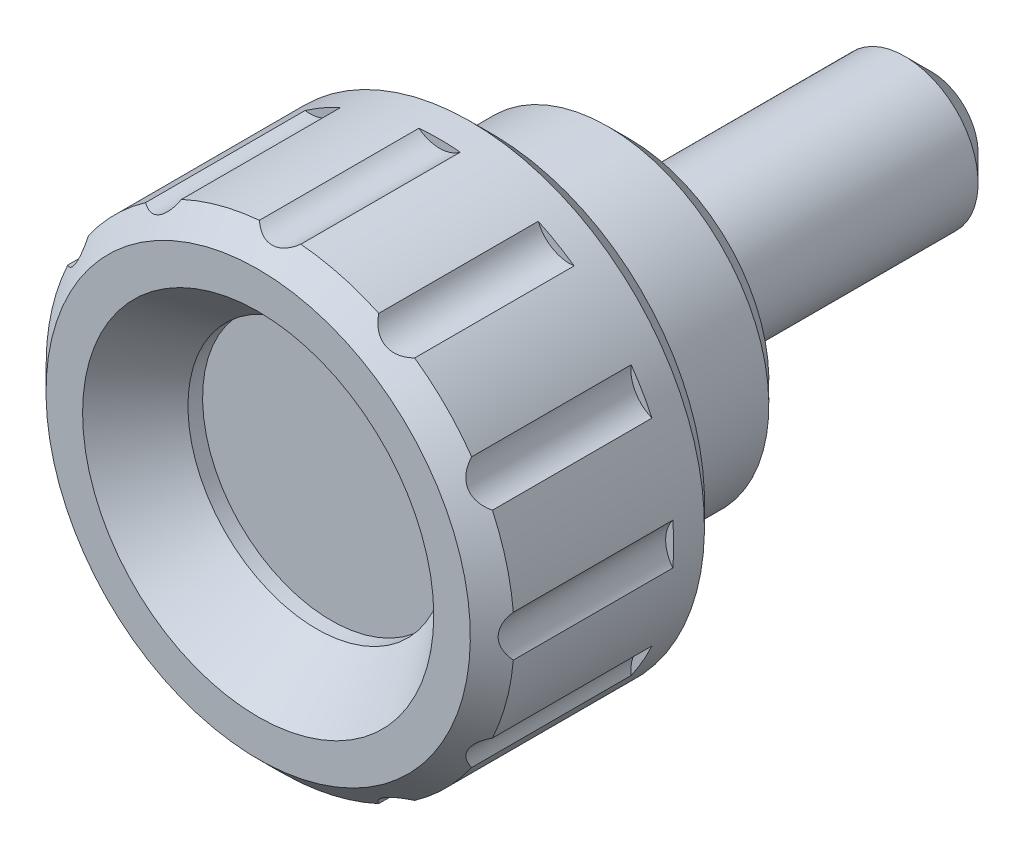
ISO-10303-21;
HEADER;
FILE_DESCRIPTION(('STEP AP214'),'2;1');
FILE_NAME('part.step','',(''),(''),'','','');
FILE_SCHEMA(('AUTOMOTIVE_DESIGN { 1 0 10303 214 1 1 1 1 }'));
ENDSEC;
DATA;
#1=APPLICATION_CONTEXT('core data for automotive mechanical design processes');
#2=APPLICATION_PROTOCOL_DEFINITION('international standard','automotive_design',2000,#1);
#3=PRODUCT_CONTEXT('',#1,'mechanical');
#4=PRODUCT('Part','Part','',(#3));
#5=PRODUCT_RELATED_PRODUCT_CATEGORY('part','',(#4));
#6=PRODUCT_DEFINITION_FORMATION('','',#4);
#7=PRODUCT_DEFINITION_CONTEXT('part definition',#1,'design');
#8=PRODUCT_DEFINITION('design','',#6,#7);
#9=PRODUCT_DEFINITION_SHAPE('','',#8);
#10=(LENGTH_UNIT() NAMED_UNIT(*) SI_UNIT(.MILLI.,.METRE.));
#11=(NAMED_UNIT(*) PLANE_ANGLE_UNIT() SI_UNIT($,.RADIAN.));
#12=(NAMED_UNIT(*) SI_UNIT($,.STERADIAN.) SOLID_ANGLE_UNIT());
#13=UNCERTAINTY_MEASURE_WITH_UNIT(LENGTH_MEASURE(1.E-05),#10,'distance_accuracy_value','');
#14=(GEOMETRIC_REPRESENTATION_CONTEXT(3) GLOBAL_UNCERTAINTY_ASSIGNED_CONTEXT((#13)) GLOBAL_UNIT_ASSIGNED_CONTEXT((#10,
#11,#12)) REPRESENTATION_CONTEXT('',''));
#15=CARTESIAN_POINT('',(0.,0.,0.));
#16=DIRECTION('',(0.,0.,1.));
#17=DIRECTION('',(1.,0.,0.));
#18=AXIS2_PLACEMENT_3D('',#15,#16,#17);
#19=CARTESIAN_POINT('',(3.49999999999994,0.,0.));
#20=DIRECTION('',(0.,0.,-1.));
#21=DIRECTION('',(0.,1.,0.));
#22=AXIS2_PLACEMENT_3D('',#19,#20,#21);
#23=PLANE('',#22);
#24=CARTESIAN_POINT('',(0.,0.,0.));
#25=DIRECTION('',(0.,0.,-1.));
#26=DIRECTION('',(-1.,0.,0.));
#27=AXIS2_PLACEMENT_3D('',#24,#25,#26);
#28=CIRCLE('',#27,3.);
#29=CARTESIAN_POINT('',(-3.,0.,0.));
#30=VERTEX_POINT('',#29);
#31=EDGE_CURVE('E195',#30,#30,#28,.F.);
#32=ORIENTED_EDGE('',*,*,#31,.F.);
#33=EDGE_LOOP('',(#32));
#34=FACE_BOUND('',#33,.T.);
#35=CARTESIAN_POINT('',(0.,0.,0.));
#36=DIRECTION('',(0.,0.,-1.));
#37=DIRECTION('',(-1.,0.,0.));
#38=AXIS2_PLACEMENT_3D('',#35,#36,#37);
#39=CIRCLE('',#38,2.5);
#40=CARTESIAN_POINT('',(-2.5,0.,0.));
#41=VERTEX_POINT('',#40);
#42=EDGE_CURVE('E462',#41,#41,#39,.T.);
#43=ORIENTED_EDGE('',*,*,#42,.F.);
#44=EDGE_LOOP('',(#43));
#45=FACE_BOUND('',#44,.T.);
#46=ADVANCED_FACE('F14',(#34,#45),#23,.T.);
#47=CARTESIAN_POINT('',(4.74999999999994,0.,0.300000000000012));
#48=DIRECTION('',(0.,0.,-1.));
#49=DIRECTION('',(0.,1.,0.));
#50=AXIS2_PLACEMENT_3D('',#47,#48,#49);
#51=PLANE('',#50);
#52=CARTESIAN_POINT('',(0.,0.,0.300000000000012));
#53=DIRECTION('',(0.,0.,-1.));
#54=DIRECTION('',(0.,1.,0.));
#55=AXIS2_PLACEMENT_3D('',#52,#53,#54);
#56=CIRCLE('',#55,4.74999999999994);
#57=CARTESIAN_POINT('',(0.,4.74999999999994,0.300000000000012));
#58=VERTEX_POINT('',#57);
#59=EDGE_CURVE('E348',#58,#58,#56,.T.);
#60=ORIENTED_EDGE('',*,*,#59,.T.);
#61=EDGE_LOOP('',(#60));
#62=FACE_BOUND('',#61,.T.);
#63=CARTESIAN_POINT('',(0.,0.,0.300000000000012));
#64=DIRECTION('',(0.,0.,-1.));
#65=DIRECTION('',(-1.,0.,0.));
#66=AXIS2_PLACEMENT_3D('',#63,#64,#65);
#67=CIRCLE('',#66,3.);
#68=CARTESIAN_POINT('',(-3.,0.,0.300000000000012));
#69=VERTEX_POINT('',#68);
#70=EDGE_CURVE('E442',#69,#69,#67,.T.);
#71=ORIENTED_EDGE('',*,*,#70,.F.);
#72=EDGE_LOOP('',(#71));
#73=FACE_BOUND('',#72,.T.);
#74=ADVANCED_FACE('F400',(#62,#73),#51,.T.);
#75=CARTESIAN_POINT('',(0.,0.,0.300000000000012));
#76=DIRECTION('',(0.,0.,1.));
#77=DIRECTION('',(0.,-1.,0.));
#78=AXIS2_PLACEMENT_3D('',#75,#76,#77);
#79=CONICAL_SURFACE('',#78,4.74999999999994,0.785398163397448);
#80=CARTESIAN_POINT('',(0.,0.,1.05000000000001));
#81=DIRECTION('',(0.,0.,-1.));
#82=DIRECTION('',(0.,1.,0.));
#83=AXIS2_PLACEMENT_3D('',#80,#81,#82);
#84=CIRCLE('',#83,5.49999999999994);
#85=CARTESIAN_POINT('',(0.,5.49999999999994,1.05000000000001));
#86=VERTEX_POINT('',#85);
#87=EDGE_CURVE('E344',#86,#86,#84,.T.);
#88=ORIENTED_EDGE('',*,*,#87,.T.);
#89=EDGE_LOOP('',(#88));
#90=FACE_BOUND('',#89,.T.);
#91=ORIENTED_EDGE('',*,*,#59,.F.);
#92=EDGE_LOOP('',(#91));
#93=FACE_BOUND('',#92,.T.);
#94=ADVANCED_FACE('F407',(#90,#93),#79,.T.);
#95=CARTESIAN_POINT('',(0.,0.,0.));
#96=DIRECTION('',(0.,0.,-1.));
#97=DIRECTION('',(0.,1.,0.));
#98=AXIS2_PLACEMENT_3D('',#95,#96,#97);
#99=CYLINDRICAL_SURFACE('',#98,5.49999999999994);
#100=CARTESIAN_POINT('',(0.,0.,5.));
#101=DIRECTION('',(0.,0.,-1.));
#102=DIRECTION('',(-1.,0.,0.));
#103=AXIS2_PLACEMENT_3D('',#100,#101,#102);
#104=CIRCLE('',#103,5.49999999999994);
#105=CARTESIAN_POINT('',(-5.49999999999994,0.,5.));
#106=VERTEX_POINT('',#105);
#107=EDGE_CURVE('E211',#106,#106,#104,.F.);
#108=ORIENTED_EDGE('',*,*,#107,.F.);
#109=EDGE_LOOP('',(#108));
#110=FACE_BOUND('',#109,.T.);
#111=ORIENTED_EDGE('',*,*,#87,.F.);
#112=EDGE_LOOP('',(#111));
#113=FACE_BOUND('',#112,.T.);
#114=ADVANCED_FACE('F475',(#110,#113),#99,.T.);
#115=CARTESIAN_POINT('',(0.,8.,5.));
#116=DIRECTION('',(0.,0.,-1.));
#117=DIRECTION('',(-1.,0.,0.));
#118=AXIS2_PLACEMENT_3D('',#115,#116,#117);
#119=PLANE('',#118);
#120=CARTESIAN_POINT('',(0.,0.,5.));
#121=DIRECTION('',(0.,0.,-1.));
#122=DIRECTION('',(-1.,0.,0.));
#123=AXIS2_PLACEMENT_3D('',#120,#121,#122);
#124=CIRCLE('',#123,7.25);
#125=CARTESIAN_POINT('',(-7.25,0.,5.));
#126=VERTEX_POINT('',#125);
#127=EDGE_CURVE('E216',#126,#126,#124,.T.);
#128=ORIENTED_EDGE('',*,*,#127,.T.);
#129=EDGE_LOOP('',(#128));
#130=FACE_BOUND('',#129,.T.);
#131=ORIENTED_EDGE('',*,*,#107,.T.);
#132=EDGE_LOOP('',(#131));
#133=FACE_BOUND('',#132,.T.);
#134=ADVANCED_FACE('F415',(#130,#133),#119,.T.);
#135=CARTESIAN_POINT('',(4.4,0.,10.5000000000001));
#136=DIRECTION('',(0.,0.,1.));
#137=DIRECTION('',(0.,-1.,0.));
#138=AXIS2_PLACEMENT_3D('',#135,#136,#137);
#139=PLANE('',#138);
#140=CARTESIAN_POINT('',(0.,0.,10.5000000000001));
#141=DIRECTION('',(0.,0.,-1.));
#142=DIRECTION('',(0.,1.,0.));
#143=AXIS2_PLACEMENT_3D('',#140,#141,#142);
#144=CIRCLE('',#143,4.4);
#145=CARTESIAN_POINT('',(0.,4.4,10.5000000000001));
#146=VERTEX_POINT('',#145);
#147=EDGE_CURVE('E288',#146,#146,#144,.T.);
#148=ORIENTED_EDGE('',*,*,#147,.F.);
#149=EDGE_LOOP('',(#148));
#150=FACE_BOUND('',#149,.T.);
#151=ADVANCED_FACE('F388',(#150),#139,.T.);
#152=CARTESIAN_POINT('',(0.,0.,0.));
#153=DIRECTION('',(0.,0.,-1.));
#154=DIRECTION('',(0.,1.,0.));
#155=AXIS2_PLACEMENT_3D('',#152,#153,#154);
#156=CYLINDRICAL_SURFACE('',#155,4.4);
#157=ORIENTED_EDGE('',*,*,#147,.T.);
#158=EDGE_LOOP('',(#157));
#159=FACE_BOUND('',#158,.T.);
#160=CARTESIAN_POINT('',(0.,0.,11.));
#161=DIRECTION('',(0.,0.,-1.));
#162=DIRECTION('',(0.,1.,0.));
#163=AXIS2_PLACEMENT_3D('',#160,#161,#162);
#164=CIRCLE('',#163,4.4);
#165=CARTESIAN_POINT('',(0.,4.4,11.));
#166=VERTEX_POINT('',#165);
#167=EDGE_CURVE('E332',#166,#166,#164,.T.);
#168=ORIENTED_EDGE('',*,*,#167,.F.);
#169=EDGE_LOOP('',(#168));
#170=FACE_BOUND('',#169,.T.);
#171=ADVANCED_FACE('F384',(#159,#170),#156,.F.);
#172=CARTESIAN_POINT('',(0.,0.,13.));
#173=DIRECTION('',(0.,0.,1.));
#174=DIRECTION('',(0.,-1.,0.));
#175=AXIS2_PLACEMENT_3D('',#172,#173,#174);
#176=CONICAL_SURFACE('',#175,6.,0.67474094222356);
#177=ORIENTED_EDGE('',*,*,#167,.T.);
#178=EDGE_LOOP('',(#177));
#179=FACE_BOUND('',#178,.T.);
#180=CARTESIAN_POINT('',(0.,0.,13.));
#181=DIRECTION('',(0.,0.,-1.));
#182=DIRECTION('',(0.,1.,0.));
#183=AXIS2_PLACEMENT_3D('',#180,#181,#182);
#184=CIRCLE('',#183,6.);
#185=CARTESIAN_POINT('',(0.,6.,13.));
#186=VERTEX_POINT('',#185);
#187=EDGE_CURVE('E335',#186,#186,#184,.T.);
#188=ORIENTED_EDGE('',*,*,#187,.F.);
#189=EDGE_LOOP('',(#188));
#190=FACE_BOUND('',#189,.T.);
#191=ADVANCED_FACE('F387',(#179,#190),#176,.F.);
#192=CARTESIAN_POINT('',(6.,0.,13.));
#193=DIRECTION('',(0.,0.,1.));
#194=DIRECTION('',(0.,-1.,0.));
#195=AXIS2_PLACEMENT_3D('',#192,#193,#194);
#196=PLANE('',#195);
#197=ORIENTED_EDGE('',*,*,#187,.T.);
#198=EDGE_LOOP('',(#197));
#199=FACE_BOUND('',#198,.T.);
#200=CARTESIAN_POINT('',(0.,0.,13.));
#201=DIRECTION('',(0.,0.,-1.));
#202=DIRECTION('',(0.,1.,0.));
#203=AXIS2_PLACEMENT_3D('',#200,#201,#202);
#204=CIRCLE('',#203,7.25);
#205=CARTESIAN_POINT('',(0.,7.25,13.));
#206=VERTEX_POINT('',#205);
#207=EDGE_CURVE('E338',#206,#206,#204,.T.);
#208=ORIENTED_EDGE('',*,*,#207,.F.);
#209=EDGE_LOOP('',(#208));
#210=FACE_BOUND('',#209,.T.);
#211=ADVANCED_FACE('F380',(#199,#210),#196,.T.);
#212=CARTESIAN_POINT('',(0.,0.,6.8));
#213=DIRECTION('',(0.,0.,1.));
#214=DIRECTION('',(0.,-1.,0.));
#215=AXIS2_PLACEMENT_3D('',#212,#213,#214);
#216=PLANE('',#215);
#217=CARTESIAN_POINT('',(-1.2490009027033E-13,-8.87500000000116,6.8));
#218=DIRECTION('',(0.,0.,-1.));
#219=DIRECTION('',(0.,-1.,0.));
#220=AXIS2_PLACEMENT_3D('',#217,#218,#219);
#221=CIRCLE('',#220,1.15);
#222=CARTESIAN_POINT('',(-0.707804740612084,-7.96862676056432,6.8));
#223=VERTEX_POINT('',#222);
#224=CARTESIAN_POINT('',(0.70780474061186,-7.96862676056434,6.8));
#225=VERTEX_POINT('',#224);
#226=EDGE_CURVE('E275',#223,#225,#221,.T.);
#227=ORIENTED_EDGE('',*,*,#226,.F.);
#228=CARTESIAN_POINT('',(0.,0.,6.8));
#229=DIRECTION('',(0.,0.,1.));
#230=DIRECTION('',(0.,-1.,0.));
#231=AXIS2_PLACEMENT_3D('',#228,#229,#230);
#232=CIRCLE('',#231,8.);
#233=EDGE_CURVE('E222',#225,#223,#232,.F.);
#234=ORIENTED_EDGE('',*,*,#233,.F.);
#235=EDGE_LOOP('',(#227,#234));
#236=FACE_BOUND('',#235,.T.);
#237=ADVANCED_FACE('F376',(#236),#216,.T.);
#238=CARTESIAN_POINT('',(-1.2490009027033E-13,-8.87500000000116,6.8));
#239=DIRECTION('',(0.,0.,1.));
#240=DIRECTION('',(0.,-1.,0.));
#241=AXIS2_PLACEMENT_3D('',#238,#239,#240);
#242=CYLINDRICAL_SURFACE('',#241,1.15);
#243=DIRECTION('',(0.,0.,1.));
#244=VECTOR('',#243,1.);
#245=CARTESIAN_POINT('',(-0.707804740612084,-7.96862676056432,6.8));
#246=LINE('',#245,#244);
#247=CARTESIAN_POINT('',(-0.707804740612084,-7.96862676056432,12.2499999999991));
#248=VERTEX_POINT('',#247);
#249=EDGE_CURVE('E301',#223,#248,#246,.T.);
#250=ORIENTED_EDGE('',*,*,#249,.F.);
#251=ORIENTED_EDGE('',*,*,#226,.T.);
#252=DIRECTION('',(0.,0.,1.));
#253=VECTOR('',#252,1.);
#254=CARTESIAN_POINT('',(0.70780474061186,-7.96862676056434,6.8));
#255=LINE('',#254,#253);
#256=CARTESIAN_POINT('',(0.707804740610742,-7.96862676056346,12.25));
#257=VERTEX_POINT('',#256);
#258=EDGE_CURVE('E299',#225,#257,#255,.T.);
#259=ORIENTED_EDGE('',*,*,#258,.T.);
#260=CARTESIAN_POINT('',(-0.708004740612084,-7.96878298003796,12.2498266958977));
#261=CARTESIAN_POINT('',(-0.670016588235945,-7.93910304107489,12.2827435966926));
#262=CARTESIAN_POINT('',(-0.629096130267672,-7.91098728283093,12.3141461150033));
#263=CARTESIAN_POINT('',(-0.541113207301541,-7.85895957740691,12.3725489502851));
#264=CARTESIAN_POINT('',(-0.493993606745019,-7.83509230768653,12.3995022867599));
#265=CARTESIAN_POINT('',(-0.403110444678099,-7.79705455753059,12.4426329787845));
#266=CARTESIAN_POINT('',(-0.360275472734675,-7.7819114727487,12.4598771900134));
#267=CARTESIAN_POINT('',(-0.271519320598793,-7.75656520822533,12.4888070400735));
#268=CARTESIAN_POINT('',(-0.225610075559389,-7.74634405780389,12.5005128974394));
#269=CARTESIAN_POINT('',(-0.131281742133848,-7.73151414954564,12.5175147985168));
#270=CARTESIAN_POINT('',(-0.0828445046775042,-7.72695427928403,12.522755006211));
#271=CARTESIAN_POINT('',(0.014487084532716,-7.72406175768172,12.5260777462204));
#272=CARTESIAN_POINT('',(0.0633815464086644,-7.72573064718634,12.5241585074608));
#273=CARTESIAN_POINT('',(0.154026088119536,-7.73456075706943,12.5140225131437));
#274=CARTESIAN_POINT('',(0.195934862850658,-7.74104594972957,12.5065809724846));
#275=CARTESIAN_POINT('',(0.277692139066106,-7.7582480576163,12.4868901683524));
#276=CARTESIAN_POINT('',(0.31753961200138,-7.76896706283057,12.4746385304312));
#277=CARTESIAN_POINT('',(0.408286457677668,-7.79851491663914,12.440973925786));
#278=CARTESIAN_POINT('',(0.458050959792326,-7.8188729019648,12.4178517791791));
#279=CARTESIAN_POINT('',(0.551931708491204,-7.86474498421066,12.3660439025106));
#280=CARTESIAN_POINT('',(0.596041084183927,-7.89026525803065,12.3373515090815));
#281=CARTESIAN_POINT('',(0.661880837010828,-7.93410696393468,12.2883657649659));
#282=CARTESIAN_POINT('',(0.685443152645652,-7.95116148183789,12.2693731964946));
#283=CARTESIAN_POINT('',(0.708004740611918,-7.96878298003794,12.2498266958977));
#284=B_SPLINE_CURVE_WITH_KNOTS('',3,(#260,#261,#262,#263,#264,#265,#266,#267,#268,#269,#270,
#271,#272,#273,#274,#275,#276,#277,#278,#279,#280,#281,#282,#283),.UNSPECIFIED.,.F.,.F.,(4,2,2,
2,2,2,2,2,2,2,2,4),(0.,0.17542065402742,0.352589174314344,0.497789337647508,0.642455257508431,
0.78836193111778,0.934304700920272,1.06290984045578,1.19157854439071,1.36619586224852,
1.54102336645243,1.64509140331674),.UNSPECIFIED.);
#285=EDGE_CURVE('E503',#248,#257,#284,.T.);
#286=ORIENTED_EDGE('',*,*,#285,.F.);
#287=EDGE_LOOP('',(#250,#251,#259,#286));
#288=FACE_BOUND('',#287,.T.);
#289=ADVANCED_FACE('F379',(#288),#242,.F.);
#290=CARTESIAN_POINT('',(4.43750000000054,-7.68597545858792,6.8));
#291=DIRECTION('',(0.,0.,-1.));
#292=DIRECTION('',(0.,-1.,0.));
#293=AXIS2_PLACEMENT_3D('',#290,#291,#292);
#294=CIRCLE('',#293,1.15);
#295=CARTESIAN_POINT('',(3.37133649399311,-7.25493557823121,6.8));
#296=VERTEX_POINT('',#295);
#297=CARTESIAN_POINT('',(4.59729026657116,-6.54713083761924,6.8));
#298=VERTEX_POINT('',#297);
#299=EDGE_CURVE('E278',#296,#298,#294,.T.);
#300=ORIENTED_EDGE('',*,*,#299,.F.);
#301=EDGE_CURVE('E218',#298,#296,#232,.F.);
#302=ORIENTED_EDGE('',*,*,#301,.F.);
#303=EDGE_LOOP('',(#300,#302));
#304=FACE_BOUND('',#303,.T.);
#305=ADVANCED_FACE('F383',(#304),#216,.T.);
#306=CARTESIAN_POINT('',(4.43750000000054,-7.68597545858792,6.8));
#307=DIRECTION('',(0.,0.,1.));
#308=DIRECTION('',(0.,-1.,0.));
#309=AXIS2_PLACEMENT_3D('',#306,#307,#308);
#310=CYLINDRICAL_SURFACE('',#309,1.15);
#311=DIRECTION('',(0.,0.,1.));
#312=VECTOR('',#311,1.);
#313=CARTESIAN_POINT('',(3.37133649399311,-7.25493557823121,6.8));
#314=LINE('',#313,#312);
#315=CARTESIAN_POINT('',(3.37133649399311,-7.25493557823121,12.2499999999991));
#316=VERTEX_POINT('',#315);
#317=EDGE_CURVE('E297',#296,#316,#314,.T.);
#318=ORIENTED_EDGE('',*,*,#317,.F.);
#319=ORIENTED_EDGE('',*,*,#299,.T.);
#320=DIRECTION('',(0.,0.,1.));
#321=VECTOR('',#320,1.);
#322=CARTESIAN_POINT('',(4.59729026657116,-6.54713083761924,6.8));
#323=LINE('',#322,#321);
#324=CARTESIAN_POINT('',(4.59729026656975,-6.54713083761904,12.25));
#325=VERTEX_POINT('',#324);
#326=EDGE_CURVE('E295',#298,#325,#323,.T.);
#327=ORIENTED_EDGE('',*,*,#326,.T.);
#328=CARTESIAN_POINT('',(3.37125565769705,-7.25513557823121,12.2498526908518));
#329=CARTESIAN_POINT('',(3.38931533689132,-7.2104398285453,12.2827673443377));
#330=CARTESIAN_POINT('',(3.41069638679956,-7.16563264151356,12.3141675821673));
#331=CARTESIAN_POINT('',(3.46087905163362,-7.07658806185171,12.3725658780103));
#332=CARTESIAN_POINT('',(3.48975247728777,-7.032360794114,12.399516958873));
#333=CARTESIAN_POINT('',(3.54944136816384,-6.95398075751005,12.4426442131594));
#334=CARTESIAN_POINT('',(3.57896658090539,-6.91945000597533,12.459887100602));
#335=CARTESIAN_POINT('',(3.64315945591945,-6.85312362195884,12.4888142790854));
#336=CARTESIAN_POINT('',(3.67780779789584,-6.82131839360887,12.5005187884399));
#337=CARTESIAN_POINT('',(3.75208390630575,-6.76131362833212,12.5175180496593));
#338=CARTESIAN_POINT('',(3.79175182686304,-6.73314735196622,12.5227569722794));
#339=CARTESIAN_POINT('',(3.87459677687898,-6.68197914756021,12.5260773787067));
#340=CARTESIAN_POINT('',(3.91777467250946,-6.65897849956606,12.5241570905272));
#341=CARTESIAN_POINT('',(4.00068974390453,-6.62130533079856,12.5140193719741));
#342=CARTESIAN_POINT('',(4.04022639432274,-6.60596809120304,12.5065770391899));
#343=CARTESIAN_POINT('',(4.1196311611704,-6.57998847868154,12.4868847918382));
#344=CARTESIAN_POINT('',(4.15949943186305,-6.56934843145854,12.4746325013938));
#345=CARTESIAN_POINT('',(4.25286326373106,-6.54956561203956,12.4409660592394));
#346=CARTESIAN_POINT('',(4.30614049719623,-6.54231471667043,12.4178426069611));
#347=CARTESIAN_POINT('',(4.41038121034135,-6.53510255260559,12.3660321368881));
#348=CARTESIAN_POINT('',(4.46134183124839,-6.53515005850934,12.3373384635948));
#349=CARTESIAN_POINT('',(4.54025639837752,-6.54019818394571,12.2883669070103));
#350=CARTESIAN_POINT('',(4.56916440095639,-6.54318368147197,12.269391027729));
#351=CARTESIAN_POINT('',(4.59749026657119,-6.5471589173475,12.2498620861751));
#352=B_SPLINE_CURVE_WITH_KNOTS('',3,(#328,#329,#330,#331,#332,#333,#334,#335,#336,#337,#338,
#339,#340,#341,#342,#343,#344,#345,#346,#347,#348,#349,#350,#351),.UNSPECIFIED.,.F.,.F.,(4,2,2,
2,2,2,2,2,2,2,2,4),(0.,0.175413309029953,0.352574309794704,0.497771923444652,0.64243531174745,
0.788339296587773,0.934279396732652,1.06288407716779,1.19155236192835,1.36617341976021,
1.54100441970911,1.64498267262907),.UNSPECIFIED.);
#353=EDGE_CURVE('E496',#316,#325,#352,.T.);
#354=ORIENTED_EDGE('',*,*,#353,.F.);
#355=EDGE_LOOP('',(#318,#319,#327,#354));
#356=FACE_BOUND('',#355,.T.);
#357=ADVANCED_FACE('F510',(#356),#310,.F.);
#358=CARTESIAN_POINT('',(7.68597545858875,-4.43749999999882,6.8));
#359=DIRECTION('',(0.,0.,-1.));
#360=DIRECTION('',(0.,-1.,0.));
#361=AXIS2_PLACEMENT_3D('',#358,#359,#360);
#362=CIRCLE('',#361,1.15000000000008);
#363=CARTESIAN_POINT('',(6.54713083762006,-4.59729026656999,6.8));
#364=VERTEX_POINT('',#363);
#365=CARTESIAN_POINT('',(7.25493557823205,-3.37133649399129,6.8));
#366=VERTEX_POINT('',#365);
#367=EDGE_CURVE('E281',#364,#366,#362,.T.);
#368=ORIENTED_EDGE('',*,*,#367,.F.);
#369=EDGE_CURVE('E212',#366,#364,#232,.F.);
#370=ORIENTED_EDGE('',*,*,#369,.F.);
#371=EDGE_LOOP('',(#368,#370));
#372=FACE_BOUND('',#371,.T.);
#373=ADVANCED_FACE('F513',(#372),#216,.T.);
#374=CARTESIAN_POINT('',(7.68597545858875,-4.43749999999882,6.8));
#375=DIRECTION('',(0.,0.,1.));
#376=DIRECTION('',(0.,-1.,0.));
#377=AXIS2_PLACEMENT_3D('',#374,#375,#376);
#378=CYLINDRICAL_SURFACE('',#377,1.15000000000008);
#379=DIRECTION('',(0.,0.,1.));
#380=VECTOR('',#379,1.);
#381=CARTESIAN_POINT('',(6.54713083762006,-4.59729026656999,6.8));
#382=LINE('',#381,#380);
#383=CARTESIAN_POINT('',(6.54713083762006,-4.59729026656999,12.2499999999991));
#384=VERTEX_POINT('',#383);
#385=EDGE_CURVE('E293',#364,#384,#382,.T.);
#386=ORIENTED_EDGE('',*,*,#385,.F.);
#387=ORIENTED_EDGE('',*,*,#367,.T.);
#388=DIRECTION('',(0.,0.,1.));
#389=VECTOR('',#388,1.);
#390=CARTESIAN_POINT('',(7.25493557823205,-3.37133649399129,6.8));
#391=LINE('',#390,#389);
#392=CARTESIAN_POINT('',(7.25493557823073,-3.37133649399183,12.25));
#393=VERTEX_POINT('',#392);
#394=EDGE_CURVE('E291',#366,#393,#391,.T.);
#395=ORIENTED_EDGE('',*,*,#394,.T.);
#396=CARTESIAN_POINT('',(6.54715891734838,-4.59749026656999,12.249862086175));
#397=CARTESIAN_POINT('',(6.54045182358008,-4.54975319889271,12.2827759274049));
#398=CARTESIAN_POINT('',(6.53656536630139,-4.50025899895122,12.3141753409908));
#399=CARTESIAN_POINT('',(6.53550363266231,-4.39805391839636,12.3725719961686));
#400=CARTESIAN_POINT('',(6.53839560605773,-4.34531590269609,12.3995222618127));
#401=CARTESIAN_POINT('',(6.55089846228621,-4.24759324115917,12.4426482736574));
#402=CARTESIAN_POINT('',(6.55920303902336,-4.20292634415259,12.4598906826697));
#403=CARTESIAN_POINT('',(6.58163319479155,-4.11339009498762,12.4888168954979));
#404=CARTESIAN_POINT('',(6.59573724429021,-4.06852209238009,12.5005209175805));
#405=CARTESIAN_POINT('',(6.63006040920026,-3.97941910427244,12.5175192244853));
#406=CARTESIAN_POINT('',(6.65033092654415,-3.93519284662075,12.5227576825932));
#407=CARTESIAN_POINT('',(6.69649299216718,-3.84945829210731,12.5260772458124));
#408=CARTESIAN_POINT('',(6.72238593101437,-3.8079506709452,12.5241565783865));
#409=CARTESIAN_POINT('',(6.77535612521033,-3.73386792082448,12.5140182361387));
#410=CARTESIAN_POINT('',(6.80192739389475,-3.70081740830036,12.5065756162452));
#411=CARTESIAN_POINT('',(6.85770436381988,-3.63861654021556,12.486882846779));
#412=CARTESIAN_POINT('',(6.88691136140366,-3.60946812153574,12.4746303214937));
#413=CARTESIAN_POINT('',(6.95787590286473,-3.54565408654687,12.4409632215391));
#414=CARTESIAN_POINT('',(7.00039031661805,-3.51273611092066,12.4178393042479));
#415=CARTESIAN_POINT('',(7.08706015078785,-3.45437012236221,12.3660279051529));
#416=CARTESIAN_POINT('',(7.13121748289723,-3.42893113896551,12.3373337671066));
#417=CARTESIAN_POINT('',(7.20208570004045,-3.39384524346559,12.2883604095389));
#418=CARTESIAN_POINT('',(7.22861528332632,-3.38197627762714,12.2693831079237));
#419=CARTESIAN_POINT('',(7.25513557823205,-3.37125565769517,12.2498526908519));
#420=B_SPLINE_CURVE_WITH_KNOTS('',3,(#396,#397,#398,#399,#400,#401,#402,#403,#404,#405,#406,
#407,#408,#409,#410,#411,#412,#413,#414,#415,#416,#417,#418,#419),.UNSPECIFIED.,.F.,.F.,(4,2,2,
2,2,2,2,2,2,2,2,4),(0.,0.175410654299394,0.352568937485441,0.497765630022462,0.642428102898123,
0.788331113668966,0.934270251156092,1.06287477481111,1.19154289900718,1.36616525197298,
1.54099757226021,1.64498268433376),.UNSPECIFIED.);
#421=EDGE_CURVE('E207',#384,#393,#420,.T.);
#422=ORIENTED_EDGE('',*,*,#421,.F.);
#423=EDGE_LOOP('',(#386,#387,#395,#422));
#424=FACE_BOUND('',#423,.T.);
#425=ADVANCED_FACE('F482',(#424),#378,.F.);
#426=CARTESIAN_POINT('',(8.87500000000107,1.83793952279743E-12,6.8));
#427=DIRECTION('',(0.,0.,-1.));
#428=DIRECTION('',(0.,-1.,0.));
#429=AXIS2_PLACEMENT_3D('',#426,#427,#428);
#430=CIRCLE('',#429,1.15);
#431=CARTESIAN_POINT('',(7.96862676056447,-0.707804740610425,6.8));
#432=VERTEX_POINT('',#431);
#433=CARTESIAN_POINT('',(7.96862676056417,0.707804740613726,6.8));
#434=VERTEX_POINT('',#433);
#435=EDGE_CURVE('E189',#432,#434,#430,.T.);
#436=ORIENTED_EDGE('',*,*,#435,.F.);
#437=EDGE_CURVE('E203',#434,#432,#232,.F.);
#438=ORIENTED_EDGE('',*,*,#437,.F.);
#439=EDGE_LOOP('',(#436,#438));
#440=FACE_BOUND('',#439,.T.);
#441=ADVANCED_FACE('F480',(#440),#216,.T.);
#442=CARTESIAN_POINT('',(8.87500000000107,1.83793952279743E-12,6.8));
#443=DIRECTION('',(0.,0.,1.));
#444=DIRECTION('',(0.,-1.,0.));
#445=AXIS2_PLACEMENT_3D('',#442,#443,#444);
#446=CYLINDRICAL_SURFACE('',#445,1.15);
#447=DIRECTION('',(0.,0.,1.));
#448=VECTOR('',#447,1.);
#449=CARTESIAN_POINT('',(7.96862676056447,-0.707804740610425,6.8));
#450=LINE('',#449,#448);
#451=CARTESIAN_POINT('',(7.96862676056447,-0.707804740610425,12.2499999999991));
#452=VERTEX_POINT('',#451);
#453=EDGE_CURVE('E289',#432,#452,#450,.T.);
#454=ORIENTED_EDGE('',*,*,#453,.F.);
#455=ORIENTED_EDGE('',*,*,#435,.T.);
#456=DIRECTION('',(0.,0.,1.));
#457=VECTOR('',#456,1.);
#458=CARTESIAN_POINT('',(7.96862676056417,0.707804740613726,6.8));
#459=LINE('',#458,#457);
#460=CARTESIAN_POINT('',(7.9686267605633,0.707804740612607,12.25));
#461=VERTEX_POINT('',#460);
#462=EDGE_CURVE('E286',#434,#461,#459,.T.);
#463=ORIENTED_EDGE('',*,*,#462,.T.);
#464=CARTESIAN_POINT('',(7.9687829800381,-0.708004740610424,12.2498266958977));
#465=CARTESIAN_POINT('',(7.93910304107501,-0.670016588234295,12.2827435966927));
#466=CARTESIAN_POINT('',(7.91098728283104,-0.629096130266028,12.3141461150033));
#467=CARTESIAN_POINT('',(7.85895957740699,-0.541113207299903,12.3725489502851));
#468=CARTESIAN_POINT('',(7.83509230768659,-0.49399360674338,12.3995022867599));
#469=CARTESIAN_POINT('',(7.79705455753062,-0.403110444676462,12.4426329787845));
#470=CARTESIAN_POINT('',(7.78191147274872,-0.36027547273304,12.4598771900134));
#471=CARTESIAN_POINT('',(7.75656520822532,-0.271519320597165,12.4888070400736));
#472=CARTESIAN_POINT('',(7.74634405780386,-0.225610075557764,12.5005128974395));
#473=CARTESIAN_POINT('',(7.73151414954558,-0.131281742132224,12.5175147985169));
#474=CARTESIAN_POINT('',(7.72695427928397,-0.0828445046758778,12.5227550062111));
#475=CARTESIAN_POINT('',(7.72406175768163,0.0144870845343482,12.5260777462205));
#476=CARTESIAN_POINT('',(7.72573064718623,0.0633815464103,12.5241585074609));
#477=CARTESIAN_POINT('',(7.7345607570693,0.154026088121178,12.5140225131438));
#478=CARTESIAN_POINT('',(7.74104594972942,0.195934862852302,12.5065809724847));
#479=CARTESIAN_POINT('',(7.75824805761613,0.277692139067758,12.4868901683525));
#480=CARTESIAN_POINT('',(7.76896706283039,0.317539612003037,12.4746385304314));
#481=CARTESIAN_POINT('',(7.79851491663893,0.408286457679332,12.4409739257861));
#482=CARTESIAN_POINT('',(7.81887290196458,0.458050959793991,12.4178517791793));
#483=CARTESIAN_POINT('',(7.86474498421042,0.551931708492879,12.3660439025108));
#484=CARTESIAN_POINT('',(7.89026525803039,0.596041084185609,12.3373515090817));
#485=CARTESIAN_POINT('',(7.93410696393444,0.661880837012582,12.288365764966));
#486=CARTESIAN_POINT('',(7.95116148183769,0.685443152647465,12.2693731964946));
#487=CARTESIAN_POINT('',(7.96878298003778,0.708004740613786,12.2498266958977));
#488=B_SPLINE_CURVE_WITH_KNOTS('',3,(#464,#465,#466,#467,#468,#469,#470,#471,#472,#473,#474,
#475,#476,#477,#478,#479,#480,#481,#482,#483,#484,#485,#486,#487),.UNSPECIFIED.,.F.,.F.,(4,2,2,
2,2,2,2,2,2,2,2,4),(0.,0.175420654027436,0.352589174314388,0.497789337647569,0.642455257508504,
0.788361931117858,0.934304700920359,1.06290984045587,1.19157854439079,1.36619586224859,
1.5410233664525,1.64509140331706),.UNSPECIFIED.);
#489=EDGE_CURVE('E201',#452,#461,#488,.T.);
#490=ORIENTED_EDGE('',*,*,#489,.F.);
#491=EDGE_LOOP('',(#454,#455,#463,#490));
#492=FACE_BOUND('',#491,.T.);
#493=ADVANCED_FACE('F476',(#492),#446,.F.);
#494=CARTESIAN_POINT('',(7.68597545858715,4.43750000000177,6.8));
#495=DIRECTION('',(0.,0.,-1.));
#496=DIRECTION('',(0.,-1.,0.));
#497=AXIS2_PLACEMENT_3D('',#494,#495,#496);
#498=CIRCLE('',#497,1.15);
#499=CARTESIAN_POINT('',(7.25493557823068,3.37133649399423,6.8));
#500=VERTEX_POINT('',#499);
#501=CARTESIAN_POINT('',(6.54713083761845,4.59729026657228,6.8));
#502=VERTEX_POINT('',#501);
#503=EDGE_CURVE('E180',#500,#502,#498,.T.);
#504=ORIENTED_EDGE('',*,*,#503,.F.);
#505=EDGE_CURVE('E193',#502,#500,#232,.F.);
#506=ORIENTED_EDGE('',*,*,#505,.F.);
#507=EDGE_LOOP('',(#504,#506));
#508=FACE_BOUND('',#507,.T.);
#509=ADVANCED_FACE('F192',(#508),#216,.T.);
#510=CARTESIAN_POINT('',(7.68597545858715,4.43750000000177,6.8));
#511=DIRECTION('',(0.,0.,1.));
#512=DIRECTION('',(0.,-1.,0.));
#513=AXIS2_PLACEMENT_3D('',#510,#511,#512);
#514=CYLINDRICAL_SURFACE('',#513,1.15);
#515=DIRECTION('',(0.,0.,1.));
#516=VECTOR('',#515,1.);
#517=CARTESIAN_POINT('',(7.25493557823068,3.37133649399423,6.8));
#518=LINE('',#517,#516);
#519=CARTESIAN_POINT('',(7.25493557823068,3.37133649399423,12.2499999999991));
#520=VERTEX_POINT('',#519);
#521=EDGE_CURVE('E177',#500,#520,#518,.T.);
#522=ORIENTED_EDGE('',*,*,#521,.F.);
#523=ORIENTED_EDGE('',*,*,#503,.T.);
#524=DIRECTION('',(0.,0.,1.));
#525=VECTOR('',#524,1.);
#526=CARTESIAN_POINT('',(6.54713083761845,4.59729026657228,6.8));
#527=LINE('',#526,#525);
#528=CARTESIAN_POINT('',(6.54713083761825,4.59729026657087,12.25));
#529=VERTEX_POINT('',#528);
#530=EDGE_CURVE('E188',#502,#529,#527,.T.);
#531=ORIENTED_EDGE('',*,*,#530,.T.);
#532=CARTESIAN_POINT('',(7.25513557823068,3.37125565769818,12.2498526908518));
#533=CARTESIAN_POINT('',(7.21043982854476,3.38931533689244,12.2827673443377));
#534=CARTESIAN_POINT('',(7.16563264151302,3.41069638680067,12.3141675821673));
#535=CARTESIAN_POINT('',(7.07658806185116,3.46087905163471,12.3725658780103));
#536=CARTESIAN_POINT('',(7.03236079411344,3.48975247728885,12.399516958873));
#537=CARTESIAN_POINT('',(6.95398075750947,3.5494413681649,12.4426442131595));
#538=CARTESIAN_POINT('',(6.91945000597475,3.57896658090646,12.459887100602));
#539=CARTESIAN_POINT('',(6.85312362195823,3.6431594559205,12.4888142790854));
#540=CARTESIAN_POINT('',(6.82131839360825,3.67780779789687,12.50051878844));
#541=CARTESIAN_POINT('',(6.76131362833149,3.75208390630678,12.5175180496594));
#542=CARTESIAN_POINT('',(6.73314735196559,3.79175182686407,12.5227569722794));
#543=CARTESIAN_POINT('',(6.68197914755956,3.87459677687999,12.5260773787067));
#544=CARTESIAN_POINT('',(6.6589784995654,3.91777467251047,12.5241570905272));
#545=CARTESIAN_POINT('',(6.62130533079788,4.00068974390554,12.5140193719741));
#546=CARTESIAN_POINT('',(6.60596809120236,4.04022639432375,12.50657703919));
#547=CARTESIAN_POINT('',(6.57998847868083,4.1196311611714,12.4868847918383));
#548=CARTESIAN_POINT('',(6.56934843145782,4.15949943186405,12.4746325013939));
#549=CARTESIAN_POINT('',(6.54956561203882,4.25286326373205,12.4409660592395));
#550=CARTESIAN_POINT('',(6.54231471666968,4.30614049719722,12.4178426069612));
#551=CARTESIAN_POINT('',(6.53510255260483,4.41038121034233,12.3660321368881));
#552=CARTESIAN_POINT('',(6.53515005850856,4.46134183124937,12.3373384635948));
#553=CARTESIAN_POINT('',(6.54019818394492,4.54025639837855,12.2883669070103));
#554=CARTESIAN_POINT('',(6.54318368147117,4.56916440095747,12.269391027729));
#555=CARTESIAN_POINT('',(6.54715891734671,4.59749026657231,12.2498620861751));
#556=B_SPLINE_CURVE_WITH_KNOTS('',3,(#532,#533,#534,#535,#536,#537,#538,#539,#540,#541,#542,
#543,#544,#545,#546,#547,#548,#549,#550,#551,#552,#553,#554,#555),.UNSPECIFIED.,.F.,.F.,(4,2,2,
2,2,2,2,2,2,2,2,4),(0.,0.175413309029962,0.352574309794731,0.497771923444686,0.642435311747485,
0.788339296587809,0.934279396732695,1.06288407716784,1.1915523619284,1.36617341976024,
1.54100441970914,1.64498267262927),.UNSPECIFIED.);
#557=EDGE_CURVE('E183',#520,#529,#556,.T.);
#558=ORIENTED_EDGE('',*,*,#557,.F.);
#559=EDGE_LOOP('',(#522,#523,#531,#558));
#560=FACE_BOUND('',#559,.T.);
#561=ADVANCED_FACE('F179',(#560),#514,.F.);
#562=CARTESIAN_POINT('',(4.43750000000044,7.68597545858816,6.8));
#563=DIRECTION('',(0.,0.,-1.));
#564=DIRECTION('',(0.,-1.,0.));
#565=AXIS2_PLACEMENT_3D('',#562,#563,#564);
#566=CIRCLE('',#565,1.15);
#567=CARTESIAN_POINT('',(4.59729026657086,6.54713083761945,6.8));
#568=VERTEX_POINT('',#567);
#569=CARTESIAN_POINT('',(3.3713364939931,7.25493557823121,6.8));
#570=VERTEX_POINT('',#569);
#571=EDGE_CURVE('E194',#568,#570,#566,.T.);
#572=ORIENTED_EDGE('',*,*,#571,.F.);
#573=EDGE_CURVE('E200',#570,#568,#232,.F.);
#574=ORIENTED_EDGE('',*,*,#573,.F.);
#575=EDGE_LOOP('',(#572,#574));
#576=FACE_BOUND('',#575,.T.);
#577=ADVANCED_FACE('F372',(#576),#216,.T.);
#578=CARTESIAN_POINT('',(4.43750000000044,7.68597545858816,6.8));
#579=DIRECTION('',(0.,0.,1.));
#580=DIRECTION('',(0.,-1.,0.));
#581=AXIS2_PLACEMENT_3D('',#578,#579,#580);
#582=CYLINDRICAL_SURFACE('',#581,1.15);
#583=DIRECTION('',(0.,0.,1.));
#584=VECTOR('',#583,1.);
#585=CARTESIAN_POINT('',(4.59729026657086,6.54713083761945,6.8));
#586=LINE('',#585,#584);
#587=CARTESIAN_POINT('',(4.59729026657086,6.54713083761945,12.2499999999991));
#588=VERTEX_POINT('',#587);
#589=EDGE_CURVE('E326',#568,#588,#586,.T.);
#590=ORIENTED_EDGE('',*,*,#589,.F.);
#591=ORIENTED_EDGE('',*,*,#571,.T.);
#592=DIRECTION('',(0.,0.,1.));
#593=VECTOR('',#592,1.);
#594=CARTESIAN_POINT('',(3.3713364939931,7.25493557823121,6.8));
#595=LINE('',#594,#593);
#596=CARTESIAN_POINT('',(3.37133649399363,7.25493557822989,12.25));
#597=VERTEX_POINT('',#596);
#598=EDGE_CURVE('E324',#570,#597,#595,.T.);
#599=ORIENTED_EDGE('',*,*,#598,.T.);
#600=CARTESIAN_POINT('',(4.59749026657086,6.54715891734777,12.249862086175));
#601=CARTESIAN_POINT('',(4.5497531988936,6.5404518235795,12.2827759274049));
#602=CARTESIAN_POINT('',(4.50025899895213,6.53656536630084,12.3141753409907));
#603=CARTESIAN_POINT('',(4.39805391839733,6.53550363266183,12.3725719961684));
#604=CARTESIAN_POINT('',(4.34531590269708,6.53839560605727,12.3995222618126));
#605=CARTESIAN_POINT('',(4.2475932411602,6.5508984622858,12.4426482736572));
#606=CARTESIAN_POINT('',(4.20292634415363,6.55920303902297,12.4598906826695));
#607=CARTESIAN_POINT('',(4.11339009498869,6.5816331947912,12.4888168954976));
#608=CARTESIAN_POINT('',(4.06852209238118,6.59573724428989,12.5005209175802));
#609=CARTESIAN_POINT('',(3.97941910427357,6.63006040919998,12.517519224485));
#610=CARTESIAN_POINT('',(3.9351928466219,6.65033092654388,12.5227576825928));
#611=CARTESIAN_POINT('',(3.84945829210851,6.69649299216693,12.526077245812));
#612=CARTESIAN_POINT('',(3.80795067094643,6.72238593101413,12.5241565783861));
#613=CARTESIAN_POINT('',(3.73386792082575,6.77535612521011,12.5140182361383));
#614=CARTESIAN_POINT('',(3.70081740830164,6.80192739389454,12.5065756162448));
#615=CARTESIAN_POINT('',(3.63861654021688,6.85770436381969,12.4868828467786));
#616=CARTESIAN_POINT('',(3.60946812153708,6.88691136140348,12.4746303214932));
#617=CARTESIAN_POINT('',(3.54565408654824,6.95787590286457,12.4409632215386));
#618=CARTESIAN_POINT('',(3.51273611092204,7.00039031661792,12.4178393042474));
#619=CARTESIAN_POINT('',(3.45437012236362,7.08706015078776,12.3660279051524));
#620=CARTESIAN_POINT('',(3.42893113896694,7.13121748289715,12.3373337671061));
#621=CARTESIAN_POINT('',(3.39384524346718,7.20208570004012,12.2883604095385));
#622=CARTESIAN_POINT('',(3.38197627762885,7.22861528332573,12.2693831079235));
#623=CARTESIAN_POINT('',(3.37125565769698,7.25513557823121,12.2498526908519));
#624=B_SPLINE_CURVE_WITH_KNOTS('',3,(#600,#601,#602,#603,#604,#605,#606,#607,#608,#609,#610,
#611,#612,#613,#614,#615,#616,#617,#618,#619,#620,#621,#622,#623),.UNSPECIFIED.,.F.,.F.,(4,2,2,
2,2,2,2,2,2,2,2,4),(0.,0.175410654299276,0.35256893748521,0.497765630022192,0.642428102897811,
0.788331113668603,0.934270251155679,1.06287477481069,1.19154289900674,1.36616525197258,
1.54099757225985,1.64498268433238),.UNSPECIFIED.);
#625=EDGE_CURVE('E358',#588,#597,#624,.T.);
#626=ORIENTED_EDGE('',*,*,#625,.F.);
#627=EDGE_LOOP('',(#590,#591,#599,#626));
#628=FACE_BOUND('',#627,.T.);
#629=ADVANCED_FACE('F373',(#628),#582,.F.);
#630=CARTESIAN_POINT('',(9.3198018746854E-13,8.8750000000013,6.8));
#631=DIRECTION('',(0.,0.,-1.));
#632=DIRECTION('',(0.,-1.,0.));
#633=AXIS2_PLACEMENT_3D('',#630,#631,#632);
#634=CIRCLE('',#633,1.15);
#635=CARTESIAN_POINT('',(0.707804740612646,7.96862676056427,6.8));
#636=VERTEX_POINT('',#635);
#637=CARTESIAN_POINT('',(-0.707804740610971,7.96862676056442,6.8));
#638=VERTEX_POINT('',#637);
#639=EDGE_CURVE('E255',#636,#638,#634,.T.);
#640=ORIENTED_EDGE('',*,*,#639,.F.);
#641=EDGE_CURVE('E205',#638,#636,#232,.F.);
#642=ORIENTED_EDGE('',*,*,#641,.F.);
#643=EDGE_LOOP('',(#640,#642));
#644=FACE_BOUND('',#643,.T.);
#645=ADVANCED_FACE('F254',(#644),#216,.T.);
#646=CARTESIAN_POINT('',(9.3198018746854E-13,8.8750000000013,6.8));
#647=DIRECTION('',(0.,0.,1.));
#648=DIRECTION('',(0.,-1.,0.));
#649=AXIS2_PLACEMENT_3D('',#646,#647,#648);
#650=CYLINDRICAL_SURFACE('',#649,1.15);
#651=DIRECTION('',(0.,0.,1.));
#652=VECTOR('',#651,1.);
#653=CARTESIAN_POINT('',(0.707804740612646,7.96862676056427,6.8));
#654=LINE('',#653,#652);
#655=CARTESIAN_POINT('',(0.707804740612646,7.96862676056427,12.2499999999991));
#656=VERTEX_POINT('',#655);
#657=EDGE_CURVE('E249',#636,#656,#654,.T.);
#658=ORIENTED_EDGE('',*,*,#657,.F.);
#659=ORIENTED_EDGE('',*,*,#639,.T.);
#660=DIRECTION('',(0.,0.,1.));
#661=VECTOR('',#660,1.);
#662=CARTESIAN_POINT('',(-0.707804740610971,7.96862676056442,6.8));
#663=LINE('',#662,#661);
#664=CARTESIAN_POINT('',(-0.707804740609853,7.96862676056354,12.25));
#665=VERTEX_POINT('',#664);
#666=EDGE_CURVE('E29',#638,#665,#663,.T.);
#667=ORIENTED_EDGE('',*,*,#666,.T.);
#668=CARTESIAN_POINT('',(0.708004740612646,7.96878298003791,12.2498266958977));
#669=CARTESIAN_POINT('',(0.670016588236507,7.93910304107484,12.2827435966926));
#670=CARTESIAN_POINT('',(0.629096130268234,7.9109872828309,12.3141461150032));
#671=CARTESIAN_POINT('',(0.541113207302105,7.85895957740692,12.372548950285));
#672=CARTESIAN_POINT('',(0.493993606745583,7.83509230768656,12.3995022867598));
#673=CARTESIAN_POINT('',(0.403110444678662,7.79705455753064,12.4426329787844));
#674=CARTESIAN_POINT('',(0.360275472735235,7.78191147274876,12.4598771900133));
#675=CARTESIAN_POINT('',(0.271519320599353,7.7565652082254,12.4888070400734));
#676=CARTESIAN_POINT('',(0.225610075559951,7.74634405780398,12.5005128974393));
#677=CARTESIAN_POINT('',(0.131281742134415,7.73151414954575,12.5175147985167));
#678=CARTESIAN_POINT('',(0.0828445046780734,7.72695427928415,12.5227550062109));
#679=CARTESIAN_POINT('',(-0.0144870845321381,7.72406175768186,12.5260777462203));
#680=CARTESIAN_POINT('',(-0.0633815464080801,7.7257306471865,12.5241585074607));
#681=CARTESIAN_POINT('',(-0.154026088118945,7.73456075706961,12.5140225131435));
#682=CARTESIAN_POINT('',(-0.195934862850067,7.74104594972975,12.5065809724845));
#683=CARTESIAN_POINT('',(-0.277692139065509,7.75824805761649,12.4868901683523));
#684=CARTESIAN_POINT('',(-0.317539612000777,7.76896706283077,12.4746385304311));
#685=CARTESIAN_POINT('',(-0.40828645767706,7.79851491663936,12.4409739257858));
#686=CARTESIAN_POINT('',(-0.458050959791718,7.81887290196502,12.4178517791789));
#687=CARTESIAN_POINT('',(-0.551931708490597,7.86474498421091,12.3660439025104));
#688=CARTESIAN_POINT('',(-0.596041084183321,7.89026525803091,12.3373515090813));
#689=CARTESIAN_POINT('',(-0.66188083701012,7.93410696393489,12.2883657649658));
#690=CARTESIAN_POINT('',(-0.685443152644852,7.95116148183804,12.2693731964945));
#691=CARTESIAN_POINT('',(-0.708004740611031,7.96878298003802,12.2498266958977));
#692=B_SPLINE_CURVE_WITH_KNOTS('',3,(#668,#669,#670,#671,#672,#673,#674,#675,#676,#677,#678,
#679,#680,#681,#682,#683,#684,#685,#686,#687,#688,#689,#690,#691),.UNSPECIFIED.,.F.,.F.,(4,2,2,
2,2,2,2,2,2,2,2,4),(0.,0.175420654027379,0.352589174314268,0.497789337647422,0.642455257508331,
0.788361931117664,0.934304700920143,1.06290984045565,1.19157854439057,1.3661958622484,
1.54102336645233,1.64509140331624),.UNSPECIFIED.);
#693=EDGE_CURVE('E576',#656,#665,#692,.T.);
#694=ORIENTED_EDGE('',*,*,#693,.F.);
#695=EDGE_LOOP('',(#658,#659,#667,#694));
#696=FACE_BOUND('',#695,.T.);
#697=ADVANCED_FACE('F256',(#696),#650,.F.);
#698=CARTESIAN_POINT('',(-4.43749999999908,7.6859754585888,6.8));
#699=DIRECTION('',(0.,0.,-1.));
#700=DIRECTION('',(0.,-1.,0.));
#701=AXIS2_PLACEMENT_3D('',#698,#699,#700);
#702=CIRCLE('',#701,1.14999999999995);
#703=CARTESIAN_POINT('',(-3.37133649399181,7.25493557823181,6.8));
#704=VERTEX_POINT('',#703);
#705=CARTESIAN_POINT('',(-4.5972902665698,6.54713083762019,6.8));
#706=VERTEX_POINT('',#705);
#707=EDGE_CURVE('E257',#704,#706,#702,.T.);
#708=ORIENTED_EDGE('',*,*,#707,.F.);
#709=EDGE_CURVE('E241',#706,#704,#232,.F.);
#710=ORIENTED_EDGE('',*,*,#709,.F.);
#711=EDGE_LOOP('',(#708,#710));
#712=FACE_BOUND('',#711,.T.);
#713=ADVANCED_FACE('F569',(#712),#216,.T.);
#714=CARTESIAN_POINT('',(-4.43749999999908,7.6859754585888,6.8));
#715=DIRECTION('',(0.,0.,1.));
#716=DIRECTION('',(0.,-1.,0.));
#717=AXIS2_PLACEMENT_3D('',#714,#715,#716);
#718=CYLINDRICAL_SURFACE('',#717,1.14999999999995);
#719=DIRECTION('',(0.,0.,1.));
#720=VECTOR('',#719,1.);
#721=CARTESIAN_POINT('',(-3.37133649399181,7.25493557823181,6.8));
#722=LINE('',#721,#720);
#723=CARTESIAN_POINT('',(-3.37133649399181,7.25493557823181,12.2499999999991));
#724=VERTEX_POINT('',#723);
#725=EDGE_CURVE('E320',#704,#724,#722,.T.);
#726=ORIENTED_EDGE('',*,*,#725,.F.);
#727=ORIENTED_EDGE('',*,*,#707,.T.);
#728=DIRECTION('',(0.,0.,1.));
#729=VECTOR('',#728,1.);
#730=CARTESIAN_POINT('',(-4.5972902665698,6.54713083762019,6.8));
#731=LINE('',#730,#729);
#732=CARTESIAN_POINT('',(-4.5972902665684,6.54713083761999,12.25));
#733=VERTEX_POINT('',#732);
#734=EDGE_CURVE('E37',#706,#733,#731,.T.);
#735=ORIENTED_EDGE('',*,*,#734,.T.);
#736=CARTESIAN_POINT('',(-3.37125565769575,7.25513557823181,12.2498526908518));
#737=CARTESIAN_POINT('',(-3.38931533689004,7.21043982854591,12.2827673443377));
#738=CARTESIAN_POINT('',(-3.41069638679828,7.16563264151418,12.3141675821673));
#739=CARTESIAN_POINT('',(-3.46087905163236,7.07658806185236,12.3725658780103));
#740=CARTESIAN_POINT('',(-3.48975247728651,7.03236079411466,12.3995169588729));
#741=CARTESIAN_POINT('',(-3.54944136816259,6.95398075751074,12.4426442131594));
#742=CARTESIAN_POINT('',(-3.57896658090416,6.91945000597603,12.4598871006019));
#743=CARTESIAN_POINT('',(-3.64315945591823,6.85312362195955,12.4888142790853));
#744=CARTESIAN_POINT('',(-3.67780779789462,6.8213183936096,12.5005187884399));
#745=CARTESIAN_POINT('',(-3.75208390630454,6.76131362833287,12.5175180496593));
#746=CARTESIAN_POINT('',(-3.79175182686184,6.73314735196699,12.5227569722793));
#747=CARTESIAN_POINT('',(-3.87459677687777,6.68197914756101,12.5260773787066));
#748=CARTESIAN_POINT('',(-3.91777467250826,6.65897849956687,12.5241570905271));
#749=CARTESIAN_POINT('',(-4.00068974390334,6.62130533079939,12.514019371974));
#750=CARTESIAN_POINT('',(-4.04022639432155,6.60596809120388,12.5065770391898));
#751=CARTESIAN_POINT('',(-4.11963116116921,6.57998847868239,12.4868847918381));
#752=CARTESIAN_POINT('',(-4.15949943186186,6.5693484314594,12.4746325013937));
#753=CARTESIAN_POINT('',(-4.25286326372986,6.54956561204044,12.4409660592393));
#754=CARTESIAN_POINT('',(-4.30614049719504,6.54231471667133,12.417842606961));
#755=CARTESIAN_POINT('',(-4.41038121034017,6.53510255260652,12.3660321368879));
#756=CARTESIAN_POINT('',(-4.4613418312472,6.53515005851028,12.3373384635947));
#757=CARTESIAN_POINT('',(-4.54025639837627,6.54019818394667,12.2883669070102));
#758=CARTESIAN_POINT('',(-4.56916440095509,6.54318368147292,12.269391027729));
#759=CARTESIAN_POINT('',(-4.59749026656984,6.54715891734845,12.2498620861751));
#760=B_SPLINE_CURVE_WITH_KNOTS('',3,(#736,#737,#738,#739,#740,#741,#742,#743,#744,#745,#746,
#747,#748,#749,#750,#751,#752,#753,#754,#755,#756,#757,#758,#759),.UNSPECIFIED.,.F.,.F.,(4,2,2,
2,2,2,2,2,2,2,2,4),(0.,0.175413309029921,0.352574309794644,0.497771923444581,0.642435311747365,
0.788339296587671,0.934279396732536,1.06288407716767,1.19155236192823,1.36617341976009,
1.54100441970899,1.64498267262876),.UNSPECIFIED.);
#761=EDGE_CURVE('E571',#724,#733,#760,.T.);
#762=ORIENTED_EDGE('',*,*,#761,.F.);
#763=EDGE_LOOP('',(#726,#727,#735,#762));
#764=FACE_BOUND('',#763,.T.);
#765=ADVANCED_FACE('F566',(#764),#718,.F.);
#766=CARTESIAN_POINT('',(-7.68597545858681,4.4375000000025,6.8));
#767=DIRECTION('',(0.,0.,-1.));
#768=DIRECTION('',(0.,-1.,0.));
#769=AXIS2_PLACEMENT_3D('',#766,#767,#768);
#770=CIRCLE('',#769,1.15);
#771=CARTESIAN_POINT('',(-6.54713083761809,4.59729026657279,6.8));
#772=VERTEX_POINT('',#771);
#773=CARTESIAN_POINT('',(-7.25493557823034,3.37133649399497,6.8));
#774=VERTEX_POINT('',#773);
#775=EDGE_CURVE('E259',#772,#774,#770,.T.);
#776=ORIENTED_EDGE('',*,*,#775,.F.);
#777=EDGE_CURVE('E237',#774,#772,#232,.F.);
#778=ORIENTED_EDGE('',*,*,#777,.F.);
#779=EDGE_LOOP('',(#776,#778));
#780=FACE_BOUND('',#779,.T.);
#781=ADVANCED_FACE('F564',(#780),#216,.T.);
#782=CARTESIAN_POINT('',(-7.68597545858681,4.4375000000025,6.8));
#783=DIRECTION('',(0.,0.,1.));
#784=DIRECTION('',(0.,-1.,0.));
#785=AXIS2_PLACEMENT_3D('',#782,#783,#784);
#786=CYLINDRICAL_SURFACE('',#785,1.15);
#787=DIRECTION('',(0.,0.,1.));
#788=VECTOR('',#787,1.);
#789=CARTESIAN_POINT('',(-6.54713083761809,4.59729026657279,6.8));
#790=LINE('',#789,#788);
#791=CARTESIAN_POINT('',(-6.54713083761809,4.59729026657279,12.2499999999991));
#792=VERTEX_POINT('',#791);
#793=EDGE_CURVE('E317',#772,#792,#790,.T.);
#794=ORIENTED_EDGE('',*,*,#793,.F.);
#795=ORIENTED_EDGE('',*,*,#775,.T.);
#796=DIRECTION('',(0.,0.,1.));
#797=VECTOR('',#796,1.);
#798=CARTESIAN_POINT('',(-7.25493557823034,3.37133649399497,6.8));
#799=LINE('',#798,#797);
#800=CARTESIAN_POINT('',(-7.25493557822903,3.3713364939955,12.25));
#801=VERTEX_POINT('',#800);
#802=EDGE_CURVE('E315',#774,#801,#799,.T.);
#803=ORIENTED_EDGE('',*,*,#802,.T.);
#804=CARTESIAN_POINT('',(-6.54715891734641,4.59749026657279,12.249862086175));
#805=CARTESIAN_POINT('',(-6.54045182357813,4.54975319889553,12.2827759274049));
#806=CARTESIAN_POINT('',(-6.53656536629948,4.50025899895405,12.3141753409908));
#807=CARTESIAN_POINT('',(-6.53550363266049,4.39805391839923,12.3725719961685));
#808=CARTESIAN_POINT('',(-6.53839560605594,4.34531590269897,12.3995222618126));
#809=CARTESIAN_POINT('',(-6.55089846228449,4.24759324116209,12.4426482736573));
#810=CARTESIAN_POINT('',(-6.55920303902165,4.20292634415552,12.4598906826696));
#811=CARTESIAN_POINT('',(-6.5816331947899,4.11339009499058,12.4888168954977));
#812=CARTESIAN_POINT('',(-6.5957372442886,4.06852209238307,12.5005209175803));
#813=CARTESIAN_POINT('',(-6.6300604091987,3.97941910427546,12.5175192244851));
#814=CARTESIAN_POINT('',(-6.65033092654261,3.93519284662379,12.522757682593));
#815=CARTESIAN_POINT('',(-6.69649299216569,3.84945829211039,12.5260772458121));
#816=CARTESIAN_POINT('',(-6.7223859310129,3.80795067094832,12.5241565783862));
#817=CARTESIAN_POINT('',(-6.7753561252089,3.73386792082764,12.5140182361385));
#818=CARTESIAN_POINT('',(-6.80192739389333,3.70081740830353,12.506575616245));
#819=CARTESIAN_POINT('',(-6.85770436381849,3.63861654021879,12.4868828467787));
#820=CARTESIAN_POINT('',(-6.88691136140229,3.60946812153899,12.4746303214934));
#821=CARTESIAN_POINT('',(-6.95787590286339,3.54565408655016,12.4409632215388));
#822=CARTESIAN_POINT('',(-7.00039031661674,3.51273611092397,12.4178393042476));
#823=CARTESIAN_POINT('',(-7.08706015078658,3.45437012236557,12.3660279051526));
#824=CARTESIAN_POINT('',(-7.13121748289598,3.4289311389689,12.3373337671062));
#825=CARTESIAN_POINT('',(-7.20208570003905,3.39384524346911,12.2883604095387));
#826=CARTESIAN_POINT('',(-7.22861528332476,3.38197627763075,12.2693831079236));
#827=CARTESIAN_POINT('',(-7.25513557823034,3.37125565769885,12.2498526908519));
#828=B_SPLINE_CURVE_WITH_KNOTS('',3,(#804,#805,#806,#807,#808,#809,#810,#811,#812,#813,#814,
#815,#816,#817,#818,#819,#820,#821,#822,#823,#824,#825,#826,#827),.UNSPECIFIED.,.F.,.F.,(4,2,2,
2,2,2,2,2,2,2,2,4),(0.,0.17541065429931,0.352568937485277,0.497765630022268,0.642428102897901,
0.788331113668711,0.934270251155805,1.06287477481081,1.19154289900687,1.36616525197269,
1.54099757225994,1.64498268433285),.UNSPECIFIED.);
#829=EDGE_CURVE('E547',#792,#801,#828,.T.);
#830=ORIENTED_EDGE('',*,*,#829,.F.);
#831=EDGE_LOOP('',(#794,#795,#803,#830));
#832=FACE_BOUND('',#831,.T.);
#833=ADVANCED_FACE('F560',(#832),#786,.F.);
#834=CARTESIAN_POINT('',(-8.8750000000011,2.03049382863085E-12,6.8));
#835=DIRECTION('',(0.,0.,-1.));
#836=DIRECTION('',(0.,-1.,0.));
#837=AXIS2_PLACEMENT_3D('',#834,#835,#836);
#838=CIRCLE('',#837,1.15);
#839=CARTESIAN_POINT('',(-7.96862676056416,0.707804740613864,6.8));
#840=VERTEX_POINT('',#839);
#841=CARTESIAN_POINT('',(-7.96862676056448,-0.707804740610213,6.8));
#842=VERTEX_POINT('',#841);
#843=EDGE_CURVE('E266',#840,#842,#838,.T.);
#844=ORIENTED_EDGE('',*,*,#843,.F.);
#845=EDGE_CURVE('E233',#842,#840,#232,.F.);
#846=ORIENTED_EDGE('',*,*,#845,.F.);
#847=EDGE_LOOP('',(#844,#846));
#848=FACE_BOUND('',#847,.T.);
#849=ADVANCED_FACE('F558',(#848),#216,.T.);
#850=CARTESIAN_POINT('',(-8.8750000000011,2.03049382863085E-12,6.8));
#851=DIRECTION('',(0.,0.,1.));
#852=DIRECTION('',(0.,-1.,0.));
#853=AXIS2_PLACEMENT_3D('',#850,#851,#852);
#854=CYLINDRICAL_SURFACE('',#853,1.15);
#855=DIRECTION('',(0.,0.,1.));
#856=VECTOR('',#855,1.);
#857=CARTESIAN_POINT('',(-7.96862676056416,0.707804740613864,6.8));
#858=LINE('',#857,#856);
#859=CARTESIAN_POINT('',(-7.96862676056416,0.707804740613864,12.2499999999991));
#860=VERTEX_POINT('',#859);
#861=EDGE_CURVE('E313',#840,#860,#858,.T.);
#862=ORIENTED_EDGE('',*,*,#861,.F.);
#863=ORIENTED_EDGE('',*,*,#843,.T.);
#864=DIRECTION('',(0.,0.,1.));
#865=VECTOR('',#864,1.);
#866=CARTESIAN_POINT('',(-7.96862676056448,-0.707804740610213,6.8));
#867=LINE('',#866,#865);
#868=CARTESIAN_POINT('',(-7.96862676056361,-0.707804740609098,12.25));
#869=VERTEX_POINT('',#868);
#870=EDGE_CURVE('E311',#842,#869,#867,.T.);
#871=ORIENTED_EDGE('',*,*,#870,.T.);
#872=CARTESIAN_POINT('',(-7.9687829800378,0.708004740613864,12.2498266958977));
#873=CARTESIAN_POINT('',(-7.93910304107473,0.670016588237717,12.2827435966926));
#874=CARTESIAN_POINT('',(-7.91098728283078,0.629096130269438,12.3141461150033));
#875=CARTESIAN_POINT('',(-7.85895957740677,0.541113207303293,12.3725489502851));
#876=CARTESIAN_POINT('',(-7.83509230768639,0.493993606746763,12.3995022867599));
#877=CARTESIAN_POINT('',(-7.79705455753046,0.403110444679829,12.4426329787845));
#878=CARTESIAN_POINT('',(-7.78191147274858,0.360275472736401,12.4598771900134));
#879=CARTESIAN_POINT('',(-7.75656520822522,0.271519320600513,12.4888070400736));
#880=CARTESIAN_POINT('',(-7.74634405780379,0.225610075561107,12.5005128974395));
#881=CARTESIAN_POINT('',(-7.73151414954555,0.131281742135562,12.5175147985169));
#882=CARTESIAN_POINT('',(-7.72695427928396,0.0828445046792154,12.5227550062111));
#883=CARTESIAN_POINT('',(-7.72406175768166,-0.0144870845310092,12.5260777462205));
#884=CARTESIAN_POINT('',(-7.72573064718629,-0.0633815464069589,12.5241585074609));
#885=CARTESIAN_POINT('',(-7.7345607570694,-0.154026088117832,12.5140225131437));
#886=CARTESIAN_POINT('',(-7.74104594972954,-0.195934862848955,12.5065809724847));
#887=CARTESIAN_POINT('',(-7.75824805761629,-0.277692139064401,12.4868901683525));
#888=CARTESIAN_POINT('',(-7.76896706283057,-0.317539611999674,12.4746385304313));
#889=CARTESIAN_POINT('',(-7.79851491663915,-0.408286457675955,12.4409739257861));
#890=CARTESIAN_POINT('',(-7.81887290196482,-0.458050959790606,12.4178517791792));
#891=CARTESIAN_POINT('',(-7.8647449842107,-0.551931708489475,12.3660439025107));
#892=CARTESIAN_POINT('',(-7.89026525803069,-0.596041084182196,12.3373515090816));
#893=CARTESIAN_POINT('',(-7.93410696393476,-0.661880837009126,12.288365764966));
#894=CARTESIAN_POINT('',(-7.951161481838,-0.685443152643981,12.2693731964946));
#895=CARTESIAN_POINT('',(-7.96878298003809,-0.708004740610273,12.2498266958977));
#896=B_SPLINE_CURVE_WITH_KNOTS('',3,(#872,#873,#874,#875,#876,#877,#878,#879,#880,#881,#882,
#883,#884,#885,#886,#887,#888,#889,#890,#891,#892,#893,#894,#895),.UNSPECIFIED.,.F.,.F.,(4,2,2,
2,2,2,2,2,2,2,2,4),(0.,0.175420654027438,0.352589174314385,0.497789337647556,0.642455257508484,
0.788361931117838,0.934304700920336,1.06290984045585,1.19157854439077,1.36619586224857,
1.54102336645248,1.64509140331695),.UNSPECIFIED.);
#897=EDGE_CURVE('E540',#860,#869,#896,.T.);
#898=ORIENTED_EDGE('',*,*,#897,.F.);
#899=EDGE_LOOP('',(#862,#863,#871,#898));
#900=FACE_BOUND('',#899,.T.);
#901=ADVANCED_FACE('F554',(#900),#854,.F.);
#902=CARTESIAN_POINT('',(-7.68597545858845,-4.43749999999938,6.8));
#903=DIRECTION('',(0.,0.,-1.));
#904=DIRECTION('',(0.,-1.,0.));
#905=AXIS2_PLACEMENT_3D('',#902,#903,#904);
#906=CIRCLE('',#905,1.15);
#907=CARTESIAN_POINT('',(-7.25493557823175,-3.37133649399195,6.8));
#908=VERTEX_POINT('',#907);
#909=CARTESIAN_POINT('',(-6.54713083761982,-4.59729026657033,6.8));
#910=VERTEX_POINT('',#909);
#911=EDGE_CURVE('E269',#908,#910,#906,.T.);
#912=ORIENTED_EDGE('',*,*,#911,.F.);
#913=EDGE_CURVE('E230',#910,#908,#232,.F.);
#914=ORIENTED_EDGE('',*,*,#913,.F.);
#915=EDGE_LOOP('',(#912,#914));
#916=FACE_BOUND('',#915,.T.);
#917=ADVANCED_FACE('F557',(#916),#216,.T.);
#918=CARTESIAN_POINT('',(-7.68597545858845,-4.43749999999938,6.8));
#919=DIRECTION('',(0.,0.,1.));
#920=DIRECTION('',(0.,-1.,0.));
#921=AXIS2_PLACEMENT_3D('',#918,#919,#920);
#922=CYLINDRICAL_SURFACE('',#921,1.15);
#923=DIRECTION('',(0.,0.,1.));
#924=VECTOR('',#923,1.);
#925=CARTESIAN_POINT('',(-7.25493557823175,-3.37133649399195,6.8));
#926=LINE('',#925,#924);
#927=CARTESIAN_POINT('',(-7.25493557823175,-3.37133649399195,12.2499999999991));
#928=VERTEX_POINT('',#927);
#929=EDGE_CURVE('E309',#908,#928,#926,.T.);
#930=ORIENTED_EDGE('',*,*,#929,.F.);
#931=ORIENTED_EDGE('',*,*,#911,.T.);
#932=DIRECTION('',(0.,0.,1.));
#933=VECTOR('',#932,1.);
#934=CARTESIAN_POINT('',(-6.54713083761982,-4.59729026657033,6.8));
#935=LINE('',#934,#933);
#936=CARTESIAN_POINT('',(-6.54713083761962,-4.59729026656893,12.25));
#937=VERTEX_POINT('',#936);
#938=EDGE_CURVE('E307',#910,#937,#935,.T.);
#939=ORIENTED_EDGE('',*,*,#938,.T.);
#940=CARTESIAN_POINT('',(-7.25513557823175,-3.37125565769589,12.2498526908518));
#941=CARTESIAN_POINT('',(-7.21043982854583,-3.38931533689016,12.2827673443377));
#942=CARTESIAN_POINT('',(-7.16563264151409,-3.4106963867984,12.3141675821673));
#943=CARTESIAN_POINT('',(-7.07658806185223,-3.46087905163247,12.3725658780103));
#944=CARTESIAN_POINT('',(-7.03236079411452,-3.48975247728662,12.399516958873));
#945=CARTESIAN_POINT('',(-6.95398075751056,-3.5494413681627,12.4426442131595));
#946=CARTESIAN_POINT('',(-6.91945000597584,-3.57896658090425,12.4598871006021));
#947=CARTESIAN_POINT('',(-6.85312362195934,-3.64315945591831,12.4888142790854));
#948=CARTESIAN_POINT('',(-6.82131839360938,-3.6778077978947,12.50051878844));
#949=CARTESIAN_POINT('',(-6.76131362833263,-3.75208390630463,12.5175180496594));
#950=CARTESIAN_POINT('',(-6.73314735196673,-3.79175182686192,12.5227569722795));
#951=CARTESIAN_POINT('',(-6.68197914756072,-3.87459677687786,12.5260773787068));
#952=CARTESIAN_POINT('',(-6.65897849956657,-3.91777467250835,12.5241570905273));
#953=CARTESIAN_POINT('',(-6.62130533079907,-4.00068974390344,12.5140193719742));
#954=CARTESIAN_POINT('',(-6.60596809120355,-4.04022639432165,12.5065770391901));
#955=CARTESIAN_POINT('',(-6.57998847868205,-4.11963116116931,12.4868847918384));
#956=CARTESIAN_POINT('',(-6.56934843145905,-4.15949943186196,12.474632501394));
#957=CARTESIAN_POINT('',(-6.54956561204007,-4.25286326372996,12.4409660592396));
#958=CARTESIAN_POINT('',(-6.54231471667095,-4.30614049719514,12.4178426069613));
#959=CARTESIAN_POINT('',(-6.53510255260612,-4.41038121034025,12.3660321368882));
#960=CARTESIAN_POINT('',(-6.53515005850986,-4.46134183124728,12.3373384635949));
#961=CARTESIAN_POINT('',(-6.54019818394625,-4.5402563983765,12.2883669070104));
#962=CARTESIAN_POINT('',(-6.54318368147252,-4.56916440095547,12.2693910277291));
#963=CARTESIAN_POINT('',(-6.54715891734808,-4.59749026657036,12.2498620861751));
#964=B_SPLINE_CURVE_WITH_KNOTS('',3,(#940,#941,#942,#943,#944,#945,#946,#947,#948,#949,#950,
#951,#952,#953,#954,#955,#956,#957,#958,#959,#960,#961,#962,#963),.UNSPECIFIED.,.F.,.F.,(4,2,2,
2,2,2,2,2,2,2,2,4),(0.,0.175413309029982,0.352574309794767,0.497771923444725,0.642435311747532,
0.788339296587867,0.934279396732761,1.0628840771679,1.19155236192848,1.36617341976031,
1.54100441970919,1.64498267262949),.UNSPECIFIED.);
#965=EDGE_CURVE('E533',#928,#937,#964,.T.);
#966=ORIENTED_EDGE('',*,*,#965,.F.);
#967=EDGE_LOOP('',(#930,#931,#939,#966));
#968=FACE_BOUND('',#967,.T.);
#969=ADVANCED_FACE('F523',(#968),#922,.F.);
#970=CARTESIAN_POINT('',(0.,0.,12.25));
#971=DIRECTION('',(0.,0.,-1.));
#972=DIRECTION('',(0.,1.,0.));
#973=AXIS2_PLACEMENT_3D('',#970,#971,#972);
#974=CONICAL_SURFACE('',#973,8.,0.785398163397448);
#975=ORIENTED_EDGE('',*,*,#207,.T.);
#976=EDGE_LOOP('',(#975));
#977=FACE_BOUND('',#976,.T.);
#978=CARTESIAN_POINT('',(0.,0.,12.25));
#979=DIRECTION('',(0.,0.,-1.));
#980=DIRECTION('',(0.,1.,0.));
#981=AXIS2_PLACEMENT_3D('',#978,#979,#980);
#982=CIRCLE('',#981,8.);
#983=EDGE_CURVE('E657',#452,#393,#982,.T.);
#984=ORIENTED_EDGE('',*,*,#983,.F.);
#985=ORIENTED_EDGE('',*,*,#489,.T.);
#986=EDGE_CURVE('E660',#520,#461,#982,.T.);
#987=ORIENTED_EDGE('',*,*,#986,.F.);
#988=ORIENTED_EDGE('',*,*,#557,.T.);
#989=EDGE_CURVE('E345',#588,#529,#982,.T.);
#990=ORIENTED_EDGE('',*,*,#989,.F.);
#991=ORIENTED_EDGE('',*,*,#625,.T.);
#992=EDGE_CURVE('E342',#656,#597,#982,.T.);
#993=ORIENTED_EDGE('',*,*,#992,.F.);
#994=ORIENTED_EDGE('',*,*,#693,.T.);
#995=EDGE_CURVE('E341',#724,#665,#982,.T.);
#996=ORIENTED_EDGE('',*,*,#995,.F.);
#997=ORIENTED_EDGE('',*,*,#761,.T.);
#998=EDGE_CURVE('E650',#792,#733,#982,.T.);
#999=ORIENTED_EDGE('',*,*,#998,.F.);
#1000=ORIENTED_EDGE('',*,*,#829,.T.);
#1001=EDGE_CURVE('E647',#860,#801,#982,.T.);
#1002=ORIENTED_EDGE('',*,*,#1001,.F.);
#1003=ORIENTED_EDGE('',*,*,#897,.T.);
#1004=EDGE_CURVE('E644',#928,#869,#982,.T.);
#1005=ORIENTED_EDGE('',*,*,#1004,.F.);
#1006=ORIENTED_EDGE('',*,*,#965,.T.);
#1007=CARTESIAN_POINT('',(-4.59729026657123,-6.54713083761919,12.2499999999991));
#1008=VERTEX_POINT('',#1007);
#1009=EDGE_CURVE('E640',#1008,#937,#982,.T.);
#1010=ORIENTED_EDGE('',*,*,#1009,.F.);
#1011=CARTESIAN_POINT('',(-4.59749026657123,-6.5471589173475,12.249862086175));
#1012=CARTESIAN_POINT('',(-4.54975319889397,-6.54045182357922,12.2827759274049));
#1013=CARTESIAN_POINT('',(-4.50025899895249,-6.53656536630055,12.3141753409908));
#1014=CARTESIAN_POINT('',(-4.39805391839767,-6.53550363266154,12.3725719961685));
#1015=CARTESIAN_POINT('',(-4.34531590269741,-6.53839560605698,12.3995222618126));
#1016=CARTESIAN_POINT('',(-4.24759324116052,-6.5508984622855,12.4426482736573));
#1017=CARTESIAN_POINT('',(-4.20292634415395,-6.55920303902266,12.4598906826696));
#1018=CARTESIAN_POINT('',(-4.113390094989,-6.58163319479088,12.4888168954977));
#1019=CARTESIAN_POINT('',(-4.06852209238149,-6.59573724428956,12.5005209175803));
#1020=CARTESIAN_POINT('',(-3.97941910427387,-6.63006040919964,12.5175192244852));
#1021=CARTESIAN_POINT('',(-3.93519284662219,-6.65033092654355,12.522757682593));
#1022=CARTESIAN_POINT('',(-3.84945829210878,-6.6964929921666,12.5260772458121));
#1023=CARTESIAN_POINT('',(-3.8079506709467,-6.7223859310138,12.5241565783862));
#1024=CARTESIAN_POINT('',(-3.73386792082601,-6.77535612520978,12.5140182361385));
#1025=CARTESIAN_POINT('',(-3.7008174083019,-6.80192739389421,12.506575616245));
#1026=CARTESIAN_POINT('',(-3.63861654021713,-6.85770436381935,12.4868828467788));
#1027=CARTESIAN_POINT('',(-3.60946812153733,-6.88691136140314,12.4746303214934));
#1028=CARTESIAN_POINT('',(-3.54565408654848,-6.95787590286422,12.4409632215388));
#1029=CARTESIAN_POINT('',(-3.51273611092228,-7.00039031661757,12.4178393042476));
#1030=CARTESIAN_POINT('',(-3.45437012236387,-7.0870601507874,12.3660279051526));
#1031=CARTESIAN_POINT('',(-3.42893113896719,-7.13121748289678,12.3373337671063));
#1032=CARTESIAN_POINT('',(-3.39384524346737,-7.20208570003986,12.2883604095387));
#1033=CARTESIAN_POINT('',(-3.38197627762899,-7.22861528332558,12.2693831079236));
#1034=CARTESIAN_POINT('',(-3.37125565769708,-7.25513557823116,12.2498526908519));
#1035=B_SPLINE_CURVE_WITH_KNOTS('',3,(#1011,#1012,#1013,#1014,#1015,#1016,#1017,#1018,#1019,
#1020,#1021,#1022,#1023,#1024,#1025,#1026,#1027,#1028,#1029,#1030,#1031,#1032,#1033,#1034),
.UNSPECIFIED.,.F.,.F.,(4,2,2,2,2,2,2,2,2,2,2,4),(0.,0.175410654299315,0.352568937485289,
0.497765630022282,0.642428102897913,0.788331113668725,0.934270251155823,1.06287477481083,
1.19154289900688,1.36616525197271,1.54099757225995,1.64498268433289),.UNSPECIFIED.);
#1036=CARTESIAN_POINT('',(-3.37133649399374,-7.25493557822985,12.25));
#1037=VERTEX_POINT('',#1036);
#1038=EDGE_CURVE('E526',#1008,#1037,#1035,.T.);
#1039=ORIENTED_EDGE('',*,*,#1038,.T.);
#1040=EDGE_CURVE('E637',#248,#1037,#982,.T.);
#1041=ORIENTED_EDGE('',*,*,#1040,.F.);
#1042=ORIENTED_EDGE('',*,*,#285,.T.);
#1043=EDGE_CURVE('E639',#316,#257,#982,.T.);
#1044=ORIENTED_EDGE('',*,*,#1043,.F.);
#1045=ORIENTED_EDGE('',*,*,#353,.T.);
#1046=EDGE_CURVE('E642',#384,#325,#982,.T.);
#1047=ORIENTED_EDGE('',*,*,#1046,.F.);
#1048=ORIENTED_EDGE('',*,*,#421,.T.);
#1049=EDGE_LOOP('',(#984,#985,#987,#988,#990,#991,#993,#994,#996,#997,#999,#1000,#1002,#1003,
#1005,#1006,#1010,#1039,#1041,#1042,#1044,#1045,#1047,#1048));
#1050=FACE_BOUND('',#1049,.T.);
#1051=ADVANCED_FACE('F365',(#977,#1050),#974,.T.);
#1052=CARTESIAN_POINT('',(-4.43750000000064,-7.68597545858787,6.8));
#1053=DIRECTION('',(0.,0.,-1.));
#1054=DIRECTION('',(0.,-1.,0.));
#1055=AXIS2_PLACEMENT_3D('',#1052,#1053,#1054);
#1056=CIRCLE('',#1055,1.15);
#1057=CARTESIAN_POINT('',(-4.59729026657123,-6.54713083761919,6.8));
#1058=VERTEX_POINT('',#1057);
#1059=CARTESIAN_POINT('',(-3.37133649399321,-7.25493557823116,6.8));
#1060=VERTEX_POINT('',#1059);
#1061=EDGE_CURVE('E272',#1058,#1060,#1056,.T.);
#1062=ORIENTED_EDGE('',*,*,#1061,.F.);
#1063=EDGE_CURVE('E226',#1060,#1058,#232,.F.);
#1064=ORIENTED_EDGE('',*,*,#1063,.F.);
#1065=EDGE_LOOP('',(#1062,#1064));
#1066=FACE_BOUND('',#1065,.T.);
#1067=ADVANCED_FACE('F382',(#1066),#216,.T.);
#1068=CARTESIAN_POINT('',(-4.43750000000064,-7.68597545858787,6.8));
#1069=DIRECTION('',(0.,0.,1.));
#1070=DIRECTION('',(0.,-1.,0.));
#1071=AXIS2_PLACEMENT_3D('',#1068,#1069,#1070);
#1072=CYLINDRICAL_SURFACE('',#1071,1.15);
#1073=DIRECTION('',(0.,0.,1.));
#1074=VECTOR('',#1073,1.);
#1075=CARTESIAN_POINT('',(-4.59729026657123,-6.54713083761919,6.8));
#1076=LINE('',#1075,#1074);
#1077=EDGE_CURVE('E305',#1058,#1008,#1076,.T.);
#1078=ORIENTED_EDGE('',*,*,#1077,.F.);
#1079=ORIENTED_EDGE('',*,*,#1061,.T.);
#1080=DIRECTION('',(0.,0.,1.));
#1081=VECTOR('',#1080,1.);
#1082=CARTESIAN_POINT('',(-3.37133649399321,-7.25493557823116,6.8));
#1083=LINE('',#1082,#1081);
#1084=EDGE_CURVE('E303',#1060,#1037,#1083,.T.);
#1085=ORIENTED_EDGE('',*,*,#1084,.T.);
#1086=ORIENTED_EDGE('',*,*,#1038,.F.);
#1087=EDGE_LOOP('',(#1078,#1079,#1085,#1086));
#1088=FACE_BOUND('',#1087,.T.);
#1089=ADVANCED_FACE('F429',(#1088),#1072,.F.);
#1090=CARTESIAN_POINT('',(0.,0.,0.));
#1091=DIRECTION('',(0.,0.,-1.));
#1092=DIRECTION('',(0.,1.,0.));
#1093=AXIS2_PLACEMENT_3D('',#1090,#1091,#1092);
#1094=CYLINDRICAL_SURFACE('',#1093,8.);
#1095=CARTESIAN_POINT('',(0.,0.,5.75));
#1096=DIRECTION('',(0.,0.,-1.));
#1097=DIRECTION('',(-1.,0.,0.));
#1098=AXIS2_PLACEMENT_3D('',#1095,#1096,#1097);
#1099=CIRCLE('',#1098,8.);
#1100=CARTESIAN_POINT('',(-8.,0.,5.75));
#1101=VERTEX_POINT('',#1100);
#1102=EDGE_CURVE('E434',#1101,#1101,#1099,.F.);
#1103=ORIENTED_EDGE('',*,*,#1102,.T.);
#1104=EDGE_LOOP('',(#1103));
#1105=FACE_BOUND('',#1104,.T.);
#1106=ORIENTED_EDGE('',*,*,#1084,.F.);
#1107=ORIENTED_EDGE('',*,*,#1063,.T.);
#1108=ORIENTED_EDGE('',*,*,#1077,.T.);
#1109=ORIENTED_EDGE('',*,*,#1009,.T.);
#1110=ORIENTED_EDGE('',*,*,#938,.F.);
#1111=ORIENTED_EDGE('',*,*,#913,.T.);
#1112=ORIENTED_EDGE('',*,*,#929,.T.);
#1113=ORIENTED_EDGE('',*,*,#1004,.T.);
#1114=ORIENTED_EDGE('',*,*,#870,.F.);
#1115=ORIENTED_EDGE('',*,*,#845,.T.);
#1116=ORIENTED_EDGE('',*,*,#861,.T.);
#1117=ORIENTED_EDGE('',*,*,#1001,.T.);
#1118=ORIENTED_EDGE('',*,*,#802,.F.);
#1119=ORIENTED_EDGE('',*,*,#777,.T.);
#1120=ORIENTED_EDGE('',*,*,#793,.T.);
#1121=ORIENTED_EDGE('',*,*,#998,.T.);
#1122=ORIENTED_EDGE('',*,*,#734,.F.);
#1123=ORIENTED_EDGE('',*,*,#709,.T.);
#1124=ORIENTED_EDGE('',*,*,#725,.T.);
#1125=ORIENTED_EDGE('',*,*,#995,.T.);
#1126=ORIENTED_EDGE('',*,*,#666,.F.);
#1127=ORIENTED_EDGE('',*,*,#641,.T.);
#1128=ORIENTED_EDGE('',*,*,#657,.T.);
#1129=ORIENTED_EDGE('',*,*,#992,.T.);
#1130=ORIENTED_EDGE('',*,*,#598,.F.);
#1131=ORIENTED_EDGE('',*,*,#573,.T.);
#1132=ORIENTED_EDGE('',*,*,#589,.T.);
#1133=ORIENTED_EDGE('',*,*,#989,.T.);
#1134=ORIENTED_EDGE('',*,*,#530,.F.);
#1135=ORIENTED_EDGE('',*,*,#505,.T.);
#1136=ORIENTED_EDGE('',*,*,#521,.T.);
#1137=ORIENTED_EDGE('',*,*,#986,.T.);
#1138=ORIENTED_EDGE('',*,*,#462,.F.);
#1139=ORIENTED_EDGE('',*,*,#437,.T.);
#1140=ORIENTED_EDGE('',*,*,#453,.T.);
#1141=ORIENTED_EDGE('',*,*,#983,.T.);
#1142=ORIENTED_EDGE('',*,*,#394,.F.);
#1143=ORIENTED_EDGE('',*,*,#369,.T.);
#1144=ORIENTED_EDGE('',*,*,#385,.T.);
#1145=ORIENTED_EDGE('',*,*,#1046,.T.);
#1146=ORIENTED_EDGE('',*,*,#326,.F.);
#1147=ORIENTED_EDGE('',*,*,#301,.T.);
#1148=ORIENTED_EDGE('',*,*,#317,.T.);
#1149=ORIENTED_EDGE('',*,*,#1043,.T.);
#1150=ORIENTED_EDGE('',*,*,#258,.F.);
#1151=ORIENTED_EDGE('',*,*,#233,.T.);
#1152=ORIENTED_EDGE('',*,*,#249,.T.);
#1153=ORIENTED_EDGE('',*,*,#1040,.T.);
#1154=EDGE_LOOP('',(#1106,#1107,#1108,#1109,#1110,#1111,#1112,#1113,#1114,#1115,#1116,#1117,
#1118,#1119,#1120,#1121,#1122,#1123,#1124,#1125,#1126,#1127,#1128,#1129,#1130,#1131,#1132,#1133,
#1134,#1135,#1136,#1137,#1138,#1139,#1140,#1141,#1142,#1143,#1144,#1145,#1146,#1147,#1148,#1149,
#1150,#1151,#1152,#1153));
#1155=FACE_BOUND('',#1154,.T.);
#1156=ADVANCED_FACE('F198',(#1105,#1155),#1094,.T.);
#1157=CARTESIAN_POINT('',(0.,0.,5.));
#1158=DIRECTION('',(0.,0.,1.));
#1159=DIRECTION('',(1.,0.,0.));
#1160=AXIS2_PLACEMENT_3D('',#1157,#1158,#1159);
#1161=CONICAL_SURFACE('',#1160,7.25,0.785398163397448);
#1162=ORIENTED_EDGE('',*,*,#1102,.F.);
#1163=EDGE_LOOP('',(#1162));
#1164=FACE_BOUND('',#1163,.T.);
#1165=ORIENTED_EDGE('',*,*,#127,.F.);
#1166=EDGE_LOOP('',(#1165));
#1167=FACE_BOUND('',#1166,.T.);
#1168=ADVANCED_FACE('F417',(#1164,#1167),#1161,.T.);
#1169=CARTESIAN_POINT('',(0.,0.,-9.7));
#1170=DIRECTION('',(0.,0.,1.));
#1171=DIRECTION('',(1.,0.,0.));
#1172=AXIS2_PLACEMENT_3D('',#1169,#1170,#1171);
#1173=CYLINDRICAL_SURFACE('',#1172,3.);
#1174=ORIENTED_EDGE('',*,*,#31,.T.);
#1175=EDGE_LOOP('',(#1174));
#1176=FACE_BOUND('',#1175,.T.);
#1177=ORIENTED_EDGE('',*,*,#70,.T.);
#1178=EDGE_LOOP('',(#1177));
#1179=FACE_BOUND('',#1178,.T.);
#1180=ADVANCED_FACE('F419',(#1176,#1179),#1173,.T.);
#1181=CARTESIAN_POINT('',(0.,0.,-10.));
#1182=DIRECTION('',(0.,0.,1.));
#1183=DIRECTION('',(1.,0.,0.));
#1184=AXIS2_PLACEMENT_3D('',#1181,#1182,#1183);
#1185=CYLINDRICAL_SURFACE('',#1184,2.5);
#1186=CARTESIAN_POINT('',(0.,0.,-9.1));
#1187=DIRECTION('',(0.,0.,-1.));
#1188=DIRECTION('',(-1.,0.,0.));
#1189=AXIS2_PLACEMENT_3D('',#1186,#1187,#1188);
#1190=CIRCLE('',#1189,2.5);
#1191=CARTESIAN_POINT('',(-2.5,0.,-9.1));
#1192=VERTEX_POINT('',#1191);
#1193=EDGE_CURVE('E9',#1192,#1192,#1190,.F.);
#1194=ORIENTED_EDGE('',*,*,#1193,.T.);
#1195=EDGE_LOOP('',(#1194));
#1196=FACE_BOUND('',#1195,.T.);
#1197=ORIENTED_EDGE('',*,*,#42,.T.);
#1198=EDGE_LOOP('',(#1197));
#1199=FACE_BOUND('',#1198,.T.);
#1200=ADVANCED_FACE('F426',(#1196,#1199),#1185,.T.);
#1201=CARTESIAN_POINT('',(0.,0.,-10.));
#1202=DIRECTION('',(0.,0.,-1.));
#1203=DIRECTION('',(-1.,0.,0.));
#1204=AXIS2_PLACEMENT_3D('',#1201,#1202,#1203);
#1205=PLANE('',#1204);
#1206=CARTESIAN_POINT('',(0.,0.,-10.));
#1207=DIRECTION('',(0.,0.,-1.));
#1208=DIRECTION('',(-1.,0.,0.));
#1209=AXIS2_PLACEMENT_3D('',#1206,#1207,#1208);
#1210=CIRCLE('',#1209,1.6);
#1211=CARTESIAN_POINT('',(-1.6,0.,-10.));
#1212=VERTEX_POINT('',#1211);
#1213=EDGE_CURVE('E22',#1212,#1212,#1210,.T.);
#1214=ORIENTED_EDGE('',*,*,#1213,.T.);
#1215=EDGE_LOOP('',(#1214));
#1216=FACE_BOUND('',#1215,.T.);
#1217=ADVANCED_FACE('F446',(#1216),#1205,.T.);
#1218=CARTESIAN_POINT('',(0.,0.,-10.));
#1219=DIRECTION('',(0.,0.,1.));
#1220=DIRECTION('',(1.,0.,0.));
#1221=AXIS2_PLACEMENT_3D('',#1218,#1219,#1220);
#1222=CONICAL_SURFACE('',#1221,1.6,0.785398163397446);
#1223=ORIENTED_EDGE('',*,*,#1193,.F.);
#1224=EDGE_LOOP('',(#1223));
#1225=FACE_BOUND('',#1224,.T.);
#1226=ORIENTED_EDGE('',*,*,#1213,.F.);
#1227=EDGE_LOOP('',(#1226));
#1228=FACE_BOUND('',#1227,.T.);
#1229=ADVANCED_FACE('F16',(#1225,#1228),#1222,.T.);
#1230=CLOSED_SHELL('',(#46,#74,#94,#114,#134,#151,#171,#191,#211,#237,#289,#305,#357,#373,#425,
#441,#493,#509,#561,#577,#629,#645,#697,#713,#765,#781,#833,#849,#901,#917,#969,#1051,#1067,
#1089,#1156,#1168,#1180,#1200,#1217,#1229));
#1231=MANIFOLD_SOLID_BREP('B1',#1230);
#1232=ADVANCED_BREP_SHAPE_REPRESENTATION('',(#18,#1231),#14);
#1233=SHAPE_DEFINITION_REPRESENTATION(#9,#1232);
ENDSEC;
END-ISO-10303-21;
